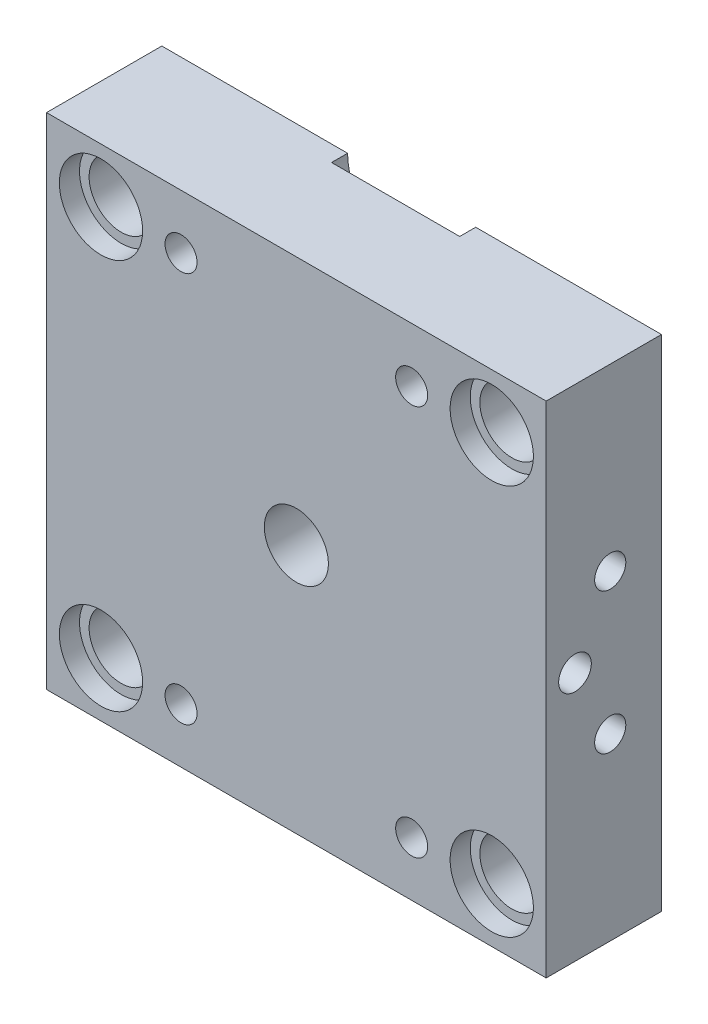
ISO-10303-21;
HEADER;
FILE_DESCRIPTION(('STEP AP214'),'2;1');
FILE_NAME('part.step','',(''),(''),'','','');
FILE_SCHEMA(('AUTOMOTIVE_DESIGN { 1 0 10303 214 1 1 1 1 }'));
ENDSEC;
DATA;
#1=APPLICATION_CONTEXT('core data for automotive mechanical design processes');
#2=APPLICATION_PROTOCOL_DEFINITION('international standard','automotive_design',2000,#1);
#3=PRODUCT_CONTEXT('',#1,'mechanical');
#4=PRODUCT('Part','Part','',(#3));
#5=PRODUCT_RELATED_PRODUCT_CATEGORY('part','',(#4));
#6=PRODUCT_DEFINITION_FORMATION('','',#4);
#7=PRODUCT_DEFINITION_CONTEXT('part definition',#1,'design');
#8=PRODUCT_DEFINITION('design','',#6,#7);
#9=PRODUCT_DEFINITION_SHAPE('','',#8);
#10=(LENGTH_UNIT() NAMED_UNIT(*) SI_UNIT(.MILLI.,.METRE.));
#11=(NAMED_UNIT(*) PLANE_ANGLE_UNIT() SI_UNIT($,.RADIAN.));
#12=(NAMED_UNIT(*) SI_UNIT($,.STERADIAN.) SOLID_ANGLE_UNIT());
#13=UNCERTAINTY_MEASURE_WITH_UNIT(LENGTH_MEASURE(1.E-05),#10,'distance_accuracy_value','');
#14=(GEOMETRIC_REPRESENTATION_CONTEXT(3) GLOBAL_UNCERTAINTY_ASSIGNED_CONTEXT((#13)) GLOBAL_UNIT_ASSIGNED_CONTEXT((#10,
#11,#12)) REPRESENTATION_CONTEXT('',''));
#15=CARTESIAN_POINT('',(0.,0.,0.));
#16=DIRECTION('',(0.,0.,1.));
#17=DIRECTION('',(1.,0.,0.));
#18=AXIS2_PLACEMENT_3D('',#15,#16,#17);
#19=CARTESIAN_POINT('',(-25.,-1.,0.3));
#20=DIRECTION('',(0.,1.,0.));
#21=DIRECTION('',(0.,0.,1.));
#22=AXIS2_PLACEMENT_3D('',#19,#20,#21);
#23=PLANE('',#22);
#24=DIRECTION('',(0.,0.,1.));
#25=VECTOR('',#24,1.);
#26=CARTESIAN_POINT('',(-27.5400642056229,-1.,3.99999999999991));
#27=LINE('',#26,#25);
#28=CARTESIAN_POINT('',(-27.5400642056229,-1.,0.));
#29=VERTEX_POINT('',#28);
#30=CARTESIAN_POINT('',(-27.5400642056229,-1.,0.199999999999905));
#31=VERTEX_POINT('',#30);
#32=EDGE_CURVE('E730',#29,#31,#27,.T.);
#33=ORIENTED_EDGE('',*,*,#32,.T.);
#34=CARTESIAN_POINT('',(-27.5404025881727,-1.,0.250629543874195));
#35=CARTESIAN_POINT('',(-27.543257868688,-1.,0.463514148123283));
#36=CARTESIAN_POINT('',(-27.5641056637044,-1.,0.676313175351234));
#37=CARTESIAN_POINT('',(-27.6412700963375,-1.,1.09556196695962));
#38=CARTESIAN_POINT('',(-27.6976295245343,-1.,1.30200375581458));
#39=CARTESIAN_POINT('',(-27.8441835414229,-1.,1.70240192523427));
#40=CARTESIAN_POINT('',(-27.9343601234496,-1.,1.89636488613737));
#41=CARTESIAN_POINT('',(-28.1459373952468,-1.,2.26636641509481));
#42=CARTESIAN_POINT('',(-28.2673303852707,-1.,2.44240938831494));
#43=CARTESIAN_POINT('',(-28.5380492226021,-1.,2.77189361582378));
#44=CARTESIAN_POINT('',(-28.6874103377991,-1.,2.92530589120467));
#45=CARTESIAN_POINT('',(-29.0097031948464,-1.,3.20497577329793));
#46=CARTESIAN_POINT('',(-29.1826361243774,-1.,3.33123201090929));
#47=CARTESIAN_POINT('',(-29.5477235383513,-1.,3.5534385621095));
#48=CARTESIAN_POINT('',(-29.7399362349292,-1.,3.64929322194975));
#49=CARTESIAN_POINT('',(-30.1376713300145,-1.,3.80754122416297));
#50=CARTESIAN_POINT('',(-30.3431939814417,-1.,3.86993393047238));
#51=CARTESIAN_POINT('',(-30.7627490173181,-1.,3.95981917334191));
#52=CARTESIAN_POINT('',(-30.9768170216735,-1.,3.98714541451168));
#53=CARTESIAN_POINT('',(-31.4065091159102,-1.,4.00569371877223));
#54=CARTESIAN_POINT('',(-31.6221332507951,-1.,3.99691473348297));
#55=CARTESIAN_POINT('',(-32.0501604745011,-1.,3.94344402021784));
#56=CARTESIAN_POINT('',(-32.2625374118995,-1.,3.89854294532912));
#57=CARTESIAN_POINT('',(-32.6768146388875,-1.,3.7739085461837));
#58=CARTESIAN_POINT('',(-32.8787145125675,-1.,3.69417384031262));
#59=CARTESIAN_POINT('',(-33.2673690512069,-1.,3.50165110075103));
#60=CARTESIAN_POINT('',(-33.4540418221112,-1.,3.38869769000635));
#61=CARTESIAN_POINT('',(-33.8057852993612,-1.,3.13305011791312));
#62=CARTESIAN_POINT('',(-33.9708553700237,-1.,2.99035508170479));
#63=CARTESIAN_POINT('',(-34.2745404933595,-1.,2.67921279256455));
#64=CARTESIAN_POINT('',(-34.413162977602,-1.,2.51077279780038));
#65=CARTESIAN_POINT('',(-34.6597887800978,-1.,2.15278676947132));
#66=CARTESIAN_POINT('',(-34.7677939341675,-1.,1.96324200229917));
#67=CARTESIAN_POINT('',(-34.9486573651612,-1.,1.57066947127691));
#68=CARTESIAN_POINT('',(-35.0219014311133,-1.,1.36781958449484));
#69=CARTESIAN_POINT('',(-35.1325544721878,-1.,0.95257710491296));
#70=CARTESIAN_POINT('',(-35.1699687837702,-1.,0.740185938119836));
#71=CARTESIAN_POINT('',(-35.2072822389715,-1.,0.31614845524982));
#72=CARTESIAN_POINT('',(-35.2078701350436,-1.,0.104562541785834));
#73=CARTESIAN_POINT('',(-35.1732466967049,-1.,-0.315651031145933));
#74=CARTESIAN_POINT('',(-35.1380366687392,-1.,-0.524278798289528));
#75=CARTESIAN_POINT('',(-35.0333878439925,-1.,-0.931280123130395));
#76=CARTESIAN_POINT('',(-34.9641753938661,-1.,-1.12971203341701));
#77=CARTESIAN_POINT('',(-34.7938731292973,-1.,-1.51238342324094));
#78=CARTESIAN_POINT('',(-34.6927808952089,-1.,-1.69662182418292));
#79=CARTESIAN_POINT('',(-34.4601656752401,-1.,-2.0484670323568));
#80=CARTESIAN_POINT('',(-34.3282387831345,-1.,-2.21580670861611));
#81=CARTESIAN_POINT('',(-34.0386077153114,-1.,-2.52645095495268));
#82=CARTESIAN_POINT('',(-33.8809013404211,-1.,-2.66975347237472));
#83=CARTESIAN_POINT('',(-33.5411762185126,-1.,-2.9307918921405));
#84=CARTESIAN_POINT('',(-33.3587825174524,-1.,-3.0480400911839));
#85=CARTESIAN_POINT('',(-32.9770046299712,-1.,-3.25050449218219));
#86=CARTESIAN_POINT('',(-32.777619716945,-1.,-3.33571932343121));
#87=CARTESIAN_POINT('',(-32.3659927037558,-1.,-3.47218298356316));
#88=CARTESIAN_POINT('',(-32.1536707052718,-1.,-3.52319103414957));
#89=CARTESIAN_POINT('',(-31.7234672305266,-1.,-3.58875212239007));
#90=CARTESIAN_POINT('',(-31.5055857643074,-1.,-3.6033052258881));
#91=CARTESIAN_POINT('',(-31.0709766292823,-1.,-3.59544451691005));
#92=CARTESIAN_POINT('',(-30.8542474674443,-1.,-3.57311380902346));
#93=CARTESIAN_POINT('',(-30.4276713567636,-1.,-3.49216845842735));
#94=CARTESIAN_POINT('',(-30.2178242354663,-1.,-3.43355472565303));
#95=CARTESIAN_POINT('',(-29.8122455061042,-1.,-3.28206219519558));
#96=CARTESIAN_POINT('',(-29.6164404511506,-1.,-3.18938003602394));
#97=CARTESIAN_POINT('',(-29.2433004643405,-1.,-2.97228320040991));
#98=CARTESIAN_POINT('',(-29.0659642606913,-1.,-2.84787071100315));
#99=CARTESIAN_POINT('',(-28.7358464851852,-1.,-2.57161680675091));
#100=CARTESIAN_POINT('',(-28.5829312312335,-1.,-2.41993511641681));
#101=CARTESIAN_POINT('',(-28.3048282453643,-1.,-2.09291365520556));
#102=CARTESIAN_POINT('',(-28.1796468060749,-1.,-1.91756852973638));
#103=CARTESIAN_POINT('',(-27.9610999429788,-1.,-1.54896075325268));
#104=CARTESIAN_POINT('',(-27.8676188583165,-1.,-1.3557665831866));
#105=CARTESIAN_POINT('',(-27.7146216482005,-1.,-0.956551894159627));
#106=CARTESIAN_POINT('',(-27.6550639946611,-1.,-0.750547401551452));
#107=CARTESIAN_POINT('',(-27.5872893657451,-1.,-0.410918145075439));
#108=CARTESIAN_POINT('',(-27.5681753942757,-1.,-0.279369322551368));
#109=CARTESIAN_POINT('',(-27.5438414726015,-1.,-0.0149927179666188));
#110=CARTESIAN_POINT('',(-27.5386215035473,-1.,0.117835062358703));
#111=CARTESIAN_POINT('',(-27.5404025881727,-1.,0.250629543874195));
#112=B_SPLINE_CURVE_WITH_KNOTS('',3,(#34,#35,#36,#37,#38,#39,#40,#41,#42,#43,#44,#45,#46,#47,
#48,#49,#50,#51,#52,#53,#54,#55,#56,#57,#58,#59,#60,#61,#62,#63,#64,#65,#66,#67,#68,#69,#70,#71,
#72,#73,#74,#75,#76,#77,#78,#79,#80,#81,#82,#83,#84,#85,#86,#87,#88,#89,#90,#91,#92,#93,#94,#95,
#96,#97,#98,#99,#100,#101,#102,#103,#104,#105,#106,#107,#108,#109,#110,#111),.UNSPECIFIED.,.T.,
.F.,(4,2,2,2,2,2,2,2,2,2,2,2,2,2,2,2,2,2,2,2,2,2,2,2,2,2,2,2,2,2,2,2,2,2,2,2,2,2,4),(0.,
0.638225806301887,1.27722213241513,1.91587869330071,2.55437787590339,3.19368769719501,
3.83302974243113,4.4743638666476,5.1157101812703,5.7600868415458,6.40448221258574,
7.05263933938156,7.70082217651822,8.35228821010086,9.00377340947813,9.65507527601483,
10.3063380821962,10.9501934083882,11.5939528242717,12.225668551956,12.857361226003,
13.4849047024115,14.1124958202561,14.7488206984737,15.3851998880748,16.0326407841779,
16.6801093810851,17.3320889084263,17.9840672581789,18.6345786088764,19.2850736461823,
19.9318716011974,20.5786249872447,21.2217067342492,21.8649342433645,22.5057889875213,
23.1458575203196,23.5439745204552,23.9420909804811),.UNSPECIFIED.);
#113=CARTESIAN_POINT('',(-27.541384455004,-1.,0.3));
#114=VERTEX_POINT('',#113);
#115=EDGE_CURVE('E193',#31,#114,#112,.T.);
#116=ORIENTED_EDGE('',*,*,#115,.T.);
#117=DIRECTION('',(1.,0.,0.));
#118=VECTOR('',#117,1.);
#119=CARTESIAN_POINT('',(-25.,-1.,0.3));
#120=LINE('',#119,#118);
#121=CARTESIAN_POINT('',(-25.,-1.,0.3));
#122=VERTEX_POINT('',#121);
#123=EDGE_CURVE('E502',#114,#122,#120,.T.);
#124=ORIENTED_EDGE('',*,*,#123,.T.);
#125=DIRECTION('',(0.,0.,-1.));
#126=VECTOR('',#125,1.);
#127=CARTESIAN_POINT('',(-25.,-1.,0.3));
#128=LINE('',#127,#126);
#129=CARTESIAN_POINT('',(-25.,-1.,0.));
#130=VERTEX_POINT('',#129);
#131=EDGE_CURVE('E488',#122,#130,#128,.T.);
#132=ORIENTED_EDGE('',*,*,#131,.T.);
#133=DIRECTION('',(1.,0.,0.));
#134=VECTOR('',#133,1.);
#135=CARTESIAN_POINT('',(-25.,-1.,0.));
#136=LINE('',#135,#134);
#137=EDGE_CURVE('E491',#29,#130,#136,.T.);
#138=ORIENTED_EDGE('',*,*,#137,.F.);
#139=EDGE_LOOP('',(#33,#116,#124,#132,#138));
#140=FACE_BOUND('',#139,.T.);
#141=ADVANCED_FACE('F41',(#140),#23,.T.);
#142=CARTESIAN_POINT('',(-28.2,1.,0.3));
#143=DIRECTION('',(0.,-1.,0.));
#144=DIRECTION('',(0.,0.,-1.));
#145=AXIS2_PLACEMENT_3D('',#142,#143,#144);
#146=PLANE('',#145);
#147=DIRECTION('',(-1.,0.,0.));
#148=VECTOR('',#147,1.);
#149=CARTESIAN_POINT('',(-28.2,1.,0.3));
#150=LINE('',#149,#148);
#151=CARTESIAN_POINT('',(-25.,1.,0.3));
#152=VERTEX_POINT('',#151);
#153=CARTESIAN_POINT('',(-27.541384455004,1.,0.3));
#154=VERTEX_POINT('',#153);
#155=EDGE_CURVE('E200',#152,#154,#150,.T.);
#156=ORIENTED_EDGE('',*,*,#155,.T.);
#157=CARTESIAN_POINT('',(-27.5404025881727,1.,0.250629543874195));
#158=CARTESIAN_POINT('',(-27.5375666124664,1.,0.03776454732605));
#159=CARTESIAN_POINT('',(-27.5527156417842,1.,-0.175495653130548));
#160=CARTESIAN_POINT('',(-27.6186350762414,1.,-0.596618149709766));
#161=CARTESIAN_POINT('',(-27.6694484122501,1.,-0.804473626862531));
#162=CARTESIAN_POINT('',(-27.8052300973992,1.,-1.20861040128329));
#163=CARTESIAN_POINT('',(-27.8901804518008,1.,-1.40489773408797));
#164=CARTESIAN_POINT('',(-28.091773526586,1.,-1.78038912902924));
#165=CARTESIAN_POINT('',(-28.2084084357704,1.,-1.95959738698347));
#166=CARTESIAN_POINT('',(-28.4701950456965,1.,-2.29614961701));
#167=CARTESIAN_POINT('',(-28.6153802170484,1.,-2.45346755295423));
#168=CARTESIAN_POINT('',(-28.9300365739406,1.,-2.74158877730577));
#169=CARTESIAN_POINT('',(-29.0995089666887,1.,-2.87239074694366));
#170=CARTESIAN_POINT('',(-29.4584537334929,1.,-3.10419654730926));
#171=CARTESIAN_POINT('',(-29.647984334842,1.,-3.20511020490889));
#172=CARTESIAN_POINT('',(-30.0412396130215,1.,-3.37384877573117));
#173=CARTESIAN_POINT('',(-30.2449645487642,1.,-3.44167308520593));
#174=CARTESIAN_POINT('',(-30.6618239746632,1.,-3.54265935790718));
#175=CARTESIAN_POINT('',(-30.8749974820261,1.,-3.57566023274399));
#176=CARTESIAN_POINT('',(-31.3038598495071,1.,-3.60562541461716));
#177=CARTESIAN_POINT('',(-31.519548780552,1.,-3.60258870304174));
#178=CARTESIAN_POINT('',(-31.9486531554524,1.,-3.56054572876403));
#179=CARTESIAN_POINT('',(-32.1620481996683,1.,-3.52133126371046));
#180=CARTESIAN_POINT('',(-32.5792986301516,1.,-3.40782662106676));
#181=CARTESIAN_POINT('',(-32.7831536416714,1.,-3.33353506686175));
#182=CARTESIAN_POINT('',(-33.1766556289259,1.,-3.15152014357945));
#183=CARTESIAN_POINT('',(-33.366222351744,1.,-3.04362322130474));
#184=CARTESIAN_POINT('',(-33.7245769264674,1.,-2.79755095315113));
#185=CARTESIAN_POINT('',(-33.893364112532,1.,-2.65937463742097));
#186=CARTESIAN_POINT('',(-34.2053267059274,1.,-2.35650758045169));
#187=CARTESIAN_POINT('',(-34.3484924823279,1.,-2.19180691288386));
#188=CARTESIAN_POINT('',(-34.6048087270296,1.,-1.84049347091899));
#189=CARTESIAN_POINT('',(-34.7179606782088,1.,-1.65388177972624));
#190=CARTESIAN_POINT('',(-34.909623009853,1.,-1.26604915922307));
#191=CARTESIAN_POINT('',(-34.9884815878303,1.,-1.06500044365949));
#192=CARTESIAN_POINT('',(-35.1105915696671,1.,-0.652371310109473));
#193=CARTESIAN_POINT('',(-35.153848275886,1.,-0.440792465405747));
#194=CARTESIAN_POINT('',(-35.2027615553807,1.,-0.0173531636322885));
#195=CARTESIAN_POINT('',(-35.2091066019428,1.,0.194427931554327));
#196=CARTESIAN_POINT('',(-35.1858172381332,1.,0.615993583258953));
#197=CARTESIAN_POINT('',(-35.1561846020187,1.,0.82577823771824));
#198=CARTESIAN_POINT('',(-35.0623694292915,1.,1.23563514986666));
#199=CARTESIAN_POINT('',(-34.9984729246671,1.,1.43577307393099));
#200=CARTESIAN_POINT('',(-34.8384063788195,1.,1.82269146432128));
#201=CARTESIAN_POINT('',(-34.7422340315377,1.,2.00947097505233));
#202=CARTESIAN_POINT('',(-34.5191424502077,1.,2.36697198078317));
#203=CARTESIAN_POINT('',(-34.3918478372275,1.,2.53745911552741));
#204=CARTESIAN_POINT('',(-34.1109108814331,1.,2.85513035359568));
#205=CARTESIAN_POINT('',(-33.9572662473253,1.,3.00231242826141));
#206=CARTESIAN_POINT('',(-33.6249833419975,1.,3.27188527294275));
#207=CARTESIAN_POINT('',(-33.4459482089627,1.,3.39378711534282));
#208=CARTESIAN_POINT('',(-33.0700801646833,1.,3.60608594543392));
#209=CARTESIAN_POINT('',(-32.8732464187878,1.,3.69648145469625));
#210=CARTESIAN_POINT('',(-32.4656602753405,1.,3.84381047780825));
#211=CARTESIAN_POINT('',(-32.2548102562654,1.,3.90047416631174));
#212=CARTESIAN_POINT('',(-31.8265799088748,1.,3.97753392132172));
#213=CARTESIAN_POINT('',(-31.6091995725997,1.,3.99792994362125));
#214=CARTESIAN_POINT('',(-31.1744856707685,1.,4.00176669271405));
#215=CARTESIAN_POINT('',(-30.9571526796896,1.,3.98527154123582));
#216=CARTESIAN_POINT('',(-30.5283908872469,1.,3.91581559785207));
#217=CARTESIAN_POINT('',(-30.3169619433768,1.,3.8628556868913));
#218=CARTESIAN_POINT('',(-29.9072736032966,1.,3.72228526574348));
#219=CARTESIAN_POINT('',(-29.7089473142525,1.,3.63486972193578));
#220=CARTESIAN_POINT('',(-29.3299133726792,1.,3.42780195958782));
#221=CARTESIAN_POINT('',(-29.1492045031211,1.,3.30815196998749));
#222=CARTESIAN_POINT('',(-28.8116223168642,1.,3.04076489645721));
#223=CARTESIAN_POINT('',(-28.6546177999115,1.,2.89319343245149));
#224=CARTESIAN_POINT('',(-28.3677044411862,1.,2.5736420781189));
#225=CARTESIAN_POINT('',(-28.2378017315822,1.,2.40165667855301));
#226=CARTESIAN_POINT('',(-28.0093527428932,1.,2.03893167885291));
#227=CARTESIAN_POINT('',(-27.9106886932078,1.,1.84826615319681));
#228=CARTESIAN_POINT('',(-27.7469826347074,1.,1.45319567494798));
#229=CARTESIAN_POINT('',(-27.6818995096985,1.,1.24880787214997));
#230=CARTESIAN_POINT('',(-27.605012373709,1.,0.911000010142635));
#231=CARTESIAN_POINT('',(-27.5823686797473,1.,0.779947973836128));
#232=CARTESIAN_POINT('',(-27.5509488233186,1.,0.516191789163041));
#233=CARTESIAN_POINT('',(-27.5421726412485,1.,0.383487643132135));
#234=CARTESIAN_POINT('',(-27.5404025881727,1.,0.250629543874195));
#235=B_SPLINE_CURVE_WITH_KNOTS('',3,(#157,#158,#159,#160,#161,#162,#163,#164,#165,#166,#167,
#168,#169,#170,#171,#172,#173,#174,#175,#176,#177,#178,#179,#180,#181,#182,#183,#184,#185,#186,
#187,#188,#189,#190,#191,#192,#193,#194,#195,#196,#197,#198,#199,#200,#201,#202,#203,#204,#205,
#206,#207,#208,#209,#210,#211,#212,#213,#214,#215,#216,#217,#218,#219,#220,#221,#222,#223,#224,
#225,#226,#227,#228,#229,#230,#231,#232,#233,#234),.UNSPECIFIED.,.T.,.F.,(4,2,2,2,2,2,2,2,2,2,2,
2,2,2,2,2,2,2,2,2,2,2,2,2,2,2,2,2,2,2,2,2,2,2,2,2,2,2,4),(0.,0.638166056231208,1.2771016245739,
1.91570082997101,2.55414274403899,3.1933376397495,3.83256431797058,4.47370034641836,
5.11484807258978,5.75894882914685,6.40306779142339,7.05091692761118,7.6987914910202,
8.3500690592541,9.00136749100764,9.65291022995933,10.3044207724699,10.9491523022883,
11.5937877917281,12.2263600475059,12.8589011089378,13.486242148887,14.1136280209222,
14.7489906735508,15.3844086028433,16.0311583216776,16.677938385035,17.3298249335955,
17.9817122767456,18.6324674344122,19.2832068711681,19.9303157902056,20.5773799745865,
21.2207199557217,21.8642053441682,22.5052350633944,23.1454780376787,23.5437851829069,
23.9420917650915),.UNSPECIFIED.);
#236=CARTESIAN_POINT('',(-27.5400642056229,0.999999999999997,0.199999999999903));
#237=VERTEX_POINT('',#236);
#238=EDGE_CURVE('E56',#154,#237,#235,.T.);
#239=ORIENTED_EDGE('',*,*,#238,.T.);
#240=DIRECTION('',(0.,0.,1.));
#241=VECTOR('',#240,1.);
#242=CARTESIAN_POINT('',(-27.5400642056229,1.,3.99999999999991));
#243=LINE('',#242,#241);
#244=CARTESIAN_POINT('',(-27.5400642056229,0.999999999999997,0.));
#245=VERTEX_POINT('',#244);
#246=EDGE_CURVE('E11',#237,#245,#243,.F.);
#247=ORIENTED_EDGE('',*,*,#246,.T.);
#248=DIRECTION('',(-1.,0.,0.));
#249=VECTOR('',#248,1.);
#250=CARTESIAN_POINT('',(-28.2,1.,0.));
#251=LINE('',#250,#249);
#252=CARTESIAN_POINT('',(-25.,1.,0.));
#253=VERTEX_POINT('',#252);
#254=EDGE_CURVE('E492',#253,#245,#251,.T.);
#255=ORIENTED_EDGE('',*,*,#254,.F.);
#256=DIRECTION('',(0.,0.,-1.));
#257=VECTOR('',#256,1.);
#258=CARTESIAN_POINT('',(-25.,1.,0.3));
#259=LINE('',#258,#257);
#260=EDGE_CURVE('E490',#152,#253,#259,.T.);
#261=ORIENTED_EDGE('',*,*,#260,.F.);
#262=EDGE_LOOP('',(#156,#239,#247,#255,#261));
#263=FACE_BOUND('',#262,.T.);
#264=ADVANCED_FACE('F197',(#263),#146,.T.);
#265=CARTESIAN_POINT('',(28.2,1.,0.3));
#266=DIRECTION('',(0.,1.,0.));
#267=DIRECTION('',(0.,0.,1.));
#268=AXIS2_PLACEMENT_3D('',#265,#266,#267);
#269=PLANE('',#268);
#270=CARTESIAN_POINT('',(27.5404025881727,1.,0.250629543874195));
#271=CARTESIAN_POINT('',(27.5375666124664,1.,0.03776454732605));
#272=CARTESIAN_POINT('',(27.5527156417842,1.,-0.175495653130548));
#273=CARTESIAN_POINT('',(27.6186350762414,1.,-0.596618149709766));
#274=CARTESIAN_POINT('',(27.6694484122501,1.,-0.804473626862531));
#275=CARTESIAN_POINT('',(27.8052300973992,1.,-1.20861040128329));
#276=CARTESIAN_POINT('',(27.8901804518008,1.,-1.40489773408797));
#277=CARTESIAN_POINT('',(28.091773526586,1.,-1.78038912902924));
#278=CARTESIAN_POINT('',(28.2084084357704,1.,-1.95959738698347));
#279=CARTESIAN_POINT('',(28.4701950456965,1.,-2.29614961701));
#280=CARTESIAN_POINT('',(28.6153802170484,1.,-2.45346755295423));
#281=CARTESIAN_POINT('',(28.9300365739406,1.,-2.74158877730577));
#282=CARTESIAN_POINT('',(29.0995089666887,1.,-2.87239074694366));
#283=CARTESIAN_POINT('',(29.4584537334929,1.,-3.10419654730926));
#284=CARTESIAN_POINT('',(29.647984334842,1.,-3.20511020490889));
#285=CARTESIAN_POINT('',(30.0412396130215,1.,-3.37384877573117));
#286=CARTESIAN_POINT('',(30.2449645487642,1.,-3.44167308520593));
#287=CARTESIAN_POINT('',(30.6618239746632,1.,-3.54265935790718));
#288=CARTESIAN_POINT('',(30.8749974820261,1.,-3.57566023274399));
#289=CARTESIAN_POINT('',(31.3038598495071,1.,-3.60562541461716));
#290=CARTESIAN_POINT('',(31.519548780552,1.,-3.60258870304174));
#291=CARTESIAN_POINT('',(31.9486531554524,1.,-3.56054572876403));
#292=CARTESIAN_POINT('',(32.1620481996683,1.,-3.52133126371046));
#293=CARTESIAN_POINT('',(32.5792986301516,1.,-3.40782662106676));
#294=CARTESIAN_POINT('',(32.7831536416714,1.,-3.33353506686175));
#295=CARTESIAN_POINT('',(33.1766556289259,1.,-3.15152014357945));
#296=CARTESIAN_POINT('',(33.366222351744,1.,-3.04362322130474));
#297=CARTESIAN_POINT('',(33.7245769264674,1.,-2.79755095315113));
#298=CARTESIAN_POINT('',(33.893364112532,1.,-2.65937463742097));
#299=CARTESIAN_POINT('',(34.2053267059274,1.,-2.35650758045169));
#300=CARTESIAN_POINT('',(34.3484924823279,1.,-2.19180691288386));
#301=CARTESIAN_POINT('',(34.6048087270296,1.,-1.84049347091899));
#302=CARTESIAN_POINT('',(34.7179606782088,1.,-1.65388177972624));
#303=CARTESIAN_POINT('',(34.909623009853,1.,-1.26604915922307));
#304=CARTESIAN_POINT('',(34.9884815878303,1.,-1.06500044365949));
#305=CARTESIAN_POINT('',(35.1105915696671,1.,-0.652371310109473));
#306=CARTESIAN_POINT('',(35.153848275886,1.,-0.440792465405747));
#307=CARTESIAN_POINT('',(35.2027615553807,1.,-0.0173531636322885));
#308=CARTESIAN_POINT('',(35.2091066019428,1.,0.194427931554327));
#309=CARTESIAN_POINT('',(35.1858172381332,1.,0.615993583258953));
#310=CARTESIAN_POINT('',(35.1561846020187,1.,0.82577823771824));
#311=CARTESIAN_POINT('',(35.0623694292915,1.,1.23563514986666));
#312=CARTESIAN_POINT('',(34.9984729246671,1.,1.43577307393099));
#313=CARTESIAN_POINT('',(34.8384063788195,1.,1.82269146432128));
#314=CARTESIAN_POINT('',(34.7422340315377,1.,2.00947097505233));
#315=CARTESIAN_POINT('',(34.5191424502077,1.,2.36697198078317));
#316=CARTESIAN_POINT('',(34.3918478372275,1.,2.53745911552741));
#317=CARTESIAN_POINT('',(34.1109108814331,1.,2.85513035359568));
#318=CARTESIAN_POINT('',(33.9572662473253,1.,3.00231242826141));
#319=CARTESIAN_POINT('',(33.6249833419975,1.,3.27188527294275));
#320=CARTESIAN_POINT('',(33.4459482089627,1.,3.39378711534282));
#321=CARTESIAN_POINT('',(33.0700801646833,1.,3.60608594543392));
#322=CARTESIAN_POINT('',(32.8732464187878,1.,3.69648145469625));
#323=CARTESIAN_POINT('',(32.4656602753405,1.,3.84381047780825));
#324=CARTESIAN_POINT('',(32.2548102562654,1.,3.90047416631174));
#325=CARTESIAN_POINT('',(31.8265799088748,1.,3.97753392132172));
#326=CARTESIAN_POINT('',(31.6091995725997,1.,3.99792994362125));
#327=CARTESIAN_POINT('',(31.1744856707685,1.,4.00176669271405));
#328=CARTESIAN_POINT('',(30.9571526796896,1.,3.98527154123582));
#329=CARTESIAN_POINT('',(30.5283908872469,1.,3.91581559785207));
#330=CARTESIAN_POINT('',(30.3169619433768,1.,3.8628556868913));
#331=CARTESIAN_POINT('',(29.9072736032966,1.,3.72228526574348));
#332=CARTESIAN_POINT('',(29.7089473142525,1.,3.63486972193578));
#333=CARTESIAN_POINT('',(29.3299133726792,1.,3.42780195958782));
#334=CARTESIAN_POINT('',(29.1492045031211,1.,3.30815196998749));
#335=CARTESIAN_POINT('',(28.8116223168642,1.,3.04076489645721));
#336=CARTESIAN_POINT('',(28.6546177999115,1.,2.89319343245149));
#337=CARTESIAN_POINT('',(28.3677044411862,1.,2.5736420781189));
#338=CARTESIAN_POINT('',(28.2378017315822,1.,2.40165667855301));
#339=CARTESIAN_POINT('',(28.0093527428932,1.,2.03893167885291));
#340=CARTESIAN_POINT('',(27.9106886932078,1.,1.84826615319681));
#341=CARTESIAN_POINT('',(27.7469826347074,1.,1.45319567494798));
#342=CARTESIAN_POINT('',(27.6818995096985,1.,1.24880787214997));
#343=CARTESIAN_POINT('',(27.605012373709,1.,0.911000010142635));
#344=CARTESIAN_POINT('',(27.5823686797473,1.,0.779947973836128));
#345=CARTESIAN_POINT('',(27.5509488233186,1.,0.516191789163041));
#346=CARTESIAN_POINT('',(27.5421726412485,1.,0.383487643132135));
#347=CARTESIAN_POINT('',(27.5404025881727,1.,0.250629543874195));
#348=B_SPLINE_CURVE_WITH_KNOTS('',3,(#270,#271,#272,#273,#274,#275,#276,#277,#278,#279,#280,
#281,#282,#283,#284,#285,#286,#287,#288,#289,#290,#291,#292,#293,#294,#295,#296,#297,#298,#299,
#300,#301,#302,#303,#304,#305,#306,#307,#308,#309,#310,#311,#312,#313,#314,#315,#316,#317,#318,
#319,#320,#321,#322,#323,#324,#325,#326,#327,#328,#329,#330,#331,#332,#333,#334,#335,#336,#337,
#338,#339,#340,#341,#342,#343,#344,#345,#346,#347),.UNSPECIFIED.,.T.,.F.,(4,2,2,2,2,2,2,2,2,2,2,
2,2,2,2,2,2,2,2,2,2,2,2,2,2,2,2,2,2,2,2,2,2,2,2,2,2,2,4),(0.,0.638166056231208,1.2771016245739,
1.91570082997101,2.55414274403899,3.1933376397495,3.83256431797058,4.47370034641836,
5.11484807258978,5.75894882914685,6.40306779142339,7.05091692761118,7.6987914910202,
8.3500690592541,9.00136749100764,9.65291022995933,10.3044207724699,10.9491523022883,
11.5937877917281,12.2263600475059,12.8589011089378,13.486242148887,14.1136280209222,
14.7489906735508,15.3844086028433,16.0311583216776,16.677938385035,17.3298249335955,
17.9817122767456,18.6324674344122,19.2832068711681,19.9303157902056,20.5773799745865,
21.2207199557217,21.8642053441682,22.5052350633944,23.1454780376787,23.5437851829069,
23.9420917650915),.UNSPECIFIED.);
#349=CARTESIAN_POINT('',(27.541384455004,1.,0.3));
#350=VERTEX_POINT('',#349);
#351=CARTESIAN_POINT('',(27.5400642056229,0.999999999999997,0.199999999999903));
#352=VERTEX_POINT('',#351);
#353=EDGE_CURVE('E244',#350,#352,#348,.T.);
#354=ORIENTED_EDGE('',*,*,#353,.F.);
#355=DIRECTION('',(1.,0.,0.));
#356=VECTOR('',#355,1.);
#357=CARTESIAN_POINT('',(28.2,1.,0.3));
#358=LINE('',#357,#356);
#359=CARTESIAN_POINT('',(25.,1.,0.3));
#360=VERTEX_POINT('',#359);
#361=EDGE_CURVE('E509',#360,#350,#358,.T.);
#362=ORIENTED_EDGE('',*,*,#361,.F.);
#363=DIRECTION('',(0.,0.,-1.));
#364=VECTOR('',#363,1.);
#365=CARTESIAN_POINT('',(25.,1.,0.3));
#366=LINE('',#365,#364);
#367=CARTESIAN_POINT('',(25.,1.,0.));
#368=VERTEX_POINT('',#367);
#369=EDGE_CURVE('E519',#360,#368,#366,.T.);
#370=ORIENTED_EDGE('',*,*,#369,.T.);
#371=DIRECTION('',(1.,0.,0.));
#372=VECTOR('',#371,1.);
#373=CARTESIAN_POINT('',(28.2,1.,0.));
#374=LINE('',#373,#372);
#375=CARTESIAN_POINT('',(27.5400642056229,1.,0.));
#376=VERTEX_POINT('',#375);
#377=EDGE_CURVE('E506',#368,#376,#374,.T.);
#378=ORIENTED_EDGE('',*,*,#377,.T.);
#379=DIRECTION('',(0.,0.,1.));
#380=VECTOR('',#379,1.);
#381=CARTESIAN_POINT('',(27.5400642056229,1.,3.99999999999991));
#382=LINE('',#381,#380);
#383=EDGE_CURVE('E495',#352,#376,#382,.F.);
#384=ORIENTED_EDGE('',*,*,#383,.F.);
#385=EDGE_LOOP('',(#354,#362,#370,#378,#384));
#386=FACE_BOUND('',#385,.T.);
#387=ADVANCED_FACE('F251',(#386),#269,.F.);
#388=CARTESIAN_POINT('',(25.,-1.,0.3));
#389=DIRECTION('',(0.,-1.,0.));
#390=DIRECTION('',(0.,0.,-1.));
#391=AXIS2_PLACEMENT_3D('',#388,#389,#390);
#392=PLANE('',#391);
#393=CARTESIAN_POINT('',(27.5404025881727,-1.,0.250629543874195));
#394=CARTESIAN_POINT('',(27.543257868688,-1.,0.463514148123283));
#395=CARTESIAN_POINT('',(27.5641056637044,-1.,0.676313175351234));
#396=CARTESIAN_POINT('',(27.6412700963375,-1.,1.09556196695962));
#397=CARTESIAN_POINT('',(27.6976295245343,-1.,1.30200375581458));
#398=CARTESIAN_POINT('',(27.8441835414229,-1.,1.70240192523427));
#399=CARTESIAN_POINT('',(27.9343601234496,-1.,1.89636488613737));
#400=CARTESIAN_POINT('',(28.1459373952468,-1.,2.26636641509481));
#401=CARTESIAN_POINT('',(28.2673303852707,-1.,2.44240938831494));
#402=CARTESIAN_POINT('',(28.5380492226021,-1.,2.77189361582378));
#403=CARTESIAN_POINT('',(28.6874103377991,-1.,2.92530589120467));
#404=CARTESIAN_POINT('',(29.0097031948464,-1.,3.20497577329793));
#405=CARTESIAN_POINT('',(29.1826361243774,-1.,3.33123201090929));
#406=CARTESIAN_POINT('',(29.5477235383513,-1.,3.5534385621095));
#407=CARTESIAN_POINT('',(29.7399362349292,-1.,3.64929322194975));
#408=CARTESIAN_POINT('',(30.1376713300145,-1.,3.80754122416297));
#409=CARTESIAN_POINT('',(30.3431939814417,-1.,3.86993393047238));
#410=CARTESIAN_POINT('',(30.7627490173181,-1.,3.95981917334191));
#411=CARTESIAN_POINT('',(30.9768170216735,-1.,3.98714541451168));
#412=CARTESIAN_POINT('',(31.4065091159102,-1.,4.00569371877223));
#413=CARTESIAN_POINT('',(31.6221332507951,-1.,3.99691473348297));
#414=CARTESIAN_POINT('',(32.0501604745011,-1.,3.94344402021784));
#415=CARTESIAN_POINT('',(32.2625374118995,-1.,3.89854294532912));
#416=CARTESIAN_POINT('',(32.6768146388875,-1.,3.7739085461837));
#417=CARTESIAN_POINT('',(32.8787145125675,-1.,3.69417384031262));
#418=CARTESIAN_POINT('',(33.2673690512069,-1.,3.50165110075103));
#419=CARTESIAN_POINT('',(33.4540418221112,-1.,3.38869769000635));
#420=CARTESIAN_POINT('',(33.8057852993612,-1.,3.13305011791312));
#421=CARTESIAN_POINT('',(33.9708553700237,-1.,2.99035508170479));
#422=CARTESIAN_POINT('',(34.2745404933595,-1.,2.67921279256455));
#423=CARTESIAN_POINT('',(34.413162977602,-1.,2.51077279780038));
#424=CARTESIAN_POINT('',(34.6597887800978,-1.,2.15278676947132));
#425=CARTESIAN_POINT('',(34.7677939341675,-1.,1.96324200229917));
#426=CARTESIAN_POINT('',(34.9486573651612,-1.,1.57066947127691));
#427=CARTESIAN_POINT('',(35.0219014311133,-1.,1.36781958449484));
#428=CARTESIAN_POINT('',(35.1325544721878,-1.,0.95257710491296));
#429=CARTESIAN_POINT('',(35.1699687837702,-1.,0.740185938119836));
#430=CARTESIAN_POINT('',(35.2072822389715,-1.,0.31614845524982));
#431=CARTESIAN_POINT('',(35.2078701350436,-1.,0.104562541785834));
#432=CARTESIAN_POINT('',(35.1732466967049,-1.,-0.315651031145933));
#433=CARTESIAN_POINT('',(35.1380366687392,-1.,-0.524278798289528));
#434=CARTESIAN_POINT('',(35.0333878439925,-1.,-0.931280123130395));
#435=CARTESIAN_POINT('',(34.9641753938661,-1.,-1.12971203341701));
#436=CARTESIAN_POINT('',(34.7938731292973,-1.,-1.51238342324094));
#437=CARTESIAN_POINT('',(34.6927808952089,-1.,-1.69662182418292));
#438=CARTESIAN_POINT('',(34.4601656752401,-1.,-2.0484670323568));
#439=CARTESIAN_POINT('',(34.3282387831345,-1.,-2.21580670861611));
#440=CARTESIAN_POINT('',(34.0386077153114,-1.,-2.52645095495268));
#441=CARTESIAN_POINT('',(33.8809013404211,-1.,-2.66975347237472));
#442=CARTESIAN_POINT('',(33.5411762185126,-1.,-2.9307918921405));
#443=CARTESIAN_POINT('',(33.3587825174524,-1.,-3.0480400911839));
#444=CARTESIAN_POINT('',(32.9770046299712,-1.,-3.25050449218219));
#445=CARTESIAN_POINT('',(32.777619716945,-1.,-3.33571932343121));
#446=CARTESIAN_POINT('',(32.3659927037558,-1.,-3.47218298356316));
#447=CARTESIAN_POINT('',(32.1536707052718,-1.,-3.52319103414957));
#448=CARTESIAN_POINT('',(31.7234672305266,-1.,-3.58875212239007));
#449=CARTESIAN_POINT('',(31.5055857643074,-1.,-3.6033052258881));
#450=CARTESIAN_POINT('',(31.0709766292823,-1.,-3.59544451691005));
#451=CARTESIAN_POINT('',(30.8542474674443,-1.,-3.57311380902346));
#452=CARTESIAN_POINT('',(30.4276713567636,-1.,-3.49216845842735));
#453=CARTESIAN_POINT('',(30.2178242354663,-1.,-3.43355472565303));
#454=CARTESIAN_POINT('',(29.8122455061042,-1.,-3.28206219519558));
#455=CARTESIAN_POINT('',(29.6164404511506,-1.,-3.18938003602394));
#456=CARTESIAN_POINT('',(29.2433004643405,-1.,-2.97228320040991));
#457=CARTESIAN_POINT('',(29.0659642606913,-1.,-2.84787071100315));
#458=CARTESIAN_POINT('',(28.7358464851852,-1.,-2.57161680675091));
#459=CARTESIAN_POINT('',(28.5829312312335,-1.,-2.41993511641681));
#460=CARTESIAN_POINT('',(28.3048282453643,-1.,-2.09291365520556));
#461=CARTESIAN_POINT('',(28.1796468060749,-1.,-1.91756852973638));
#462=CARTESIAN_POINT('',(27.9610999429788,-1.,-1.54896075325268));
#463=CARTESIAN_POINT('',(27.8676188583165,-1.,-1.3557665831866));
#464=CARTESIAN_POINT('',(27.7146216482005,-1.,-0.956551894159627));
#465=CARTESIAN_POINT('',(27.6550639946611,-1.,-0.750547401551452));
#466=CARTESIAN_POINT('',(27.5872893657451,-1.,-0.410918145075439));
#467=CARTESIAN_POINT('',(27.5681753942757,-1.,-0.279369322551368));
#468=CARTESIAN_POINT('',(27.5438414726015,-1.,-0.0149927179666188));
#469=CARTESIAN_POINT('',(27.5386215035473,-1.,0.117835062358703));
#470=CARTESIAN_POINT('',(27.5404025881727,-1.,0.250629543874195));
#471=B_SPLINE_CURVE_WITH_KNOTS('',3,(#393,#394,#395,#396,#397,#398,#399,#400,#401,#402,#403,
#404,#405,#406,#407,#408,#409,#410,#411,#412,#413,#414,#415,#416,#417,#418,#419,#420,#421,#422,
#423,#424,#425,#426,#427,#428,#429,#430,#431,#432,#433,#434,#435,#436,#437,#438,#439,#440,#441,
#442,#443,#444,#445,#446,#447,#448,#449,#450,#451,#452,#453,#454,#455,#456,#457,#458,#459,#460,
#461,#462,#463,#464,#465,#466,#467,#468,#469,#470),.UNSPECIFIED.,.T.,.F.,(4,2,2,2,2,2,2,2,2,2,2,
2,2,2,2,2,2,2,2,2,2,2,2,2,2,2,2,2,2,2,2,2,2,2,2,2,2,2,4),(0.,0.638225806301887,1.27722213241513,
1.91587869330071,2.55437787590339,3.19368769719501,3.83302974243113,4.4743638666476,
5.1157101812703,5.7600868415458,6.40448221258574,7.05263933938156,7.70082217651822,
8.35228821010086,9.00377340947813,9.65507527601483,10.3063380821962,10.9501934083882,
11.5939528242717,12.225668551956,12.857361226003,13.4849047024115,14.1124958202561,
14.7488206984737,15.3851998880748,16.0326407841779,16.6801093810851,17.3320889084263,
17.9840672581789,18.6345786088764,19.2850736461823,19.9318716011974,20.5786249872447,
21.2217067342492,21.8649342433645,22.5057889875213,23.1458575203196,23.5439745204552,
23.9420909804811),.UNSPECIFIED.);
#472=CARTESIAN_POINT('',(27.5400642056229,-1.,0.199999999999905));
#473=VERTEX_POINT('',#472);
#474=CARTESIAN_POINT('',(27.541384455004,-1.,0.3));
#475=VERTEX_POINT('',#474);
#476=EDGE_CURVE('E64',#473,#475,#471,.T.);
#477=ORIENTED_EDGE('',*,*,#476,.F.);
#478=DIRECTION('',(0.,0.,1.));
#479=VECTOR('',#478,1.);
#480=CARTESIAN_POINT('',(27.5400642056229,-1.,3.99999999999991));
#481=LINE('',#480,#479);
#482=CARTESIAN_POINT('',(27.5400642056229,-1.,0.));
#483=VERTEX_POINT('',#482);
#484=EDGE_CURVE('E727',#483,#473,#481,.T.);
#485=ORIENTED_EDGE('',*,*,#484,.F.);
#486=DIRECTION('',(-1.,0.,0.));
#487=VECTOR('',#486,1.);
#488=CARTESIAN_POINT('',(25.,-1.,0.));
#489=LINE('',#488,#487);
#490=CARTESIAN_POINT('',(25.,-1.,0.));
#491=VERTEX_POINT('',#490);
#492=EDGE_CURVE('E500',#483,#491,#489,.T.);
#493=ORIENTED_EDGE('',*,*,#492,.T.);
#494=DIRECTION('',(0.,0.,-1.));
#495=VECTOR('',#494,1.);
#496=CARTESIAN_POINT('',(25.,-1.,0.3));
#497=LINE('',#496,#495);
#498=CARTESIAN_POINT('',(25.,-1.,0.3));
#499=VERTEX_POINT('',#498);
#500=EDGE_CURVE('E512',#499,#491,#497,.T.);
#501=ORIENTED_EDGE('',*,*,#500,.F.);
#502=DIRECTION('',(-1.,0.,0.));
#503=VECTOR('',#502,1.);
#504=CARTESIAN_POINT('',(25.,-1.,0.3));
#505=LINE('',#504,#503);
#506=EDGE_CURVE('E503',#475,#499,#505,.T.);
#507=ORIENTED_EDGE('',*,*,#506,.F.);
#508=EDGE_LOOP('',(#477,#485,#493,#501,#507));
#509=FACE_BOUND('',#508,.T.);
#510=ADVANCED_FACE('F255',(#509),#392,.F.);
#511=CARTESIAN_POINT('',(-78.,-78.,0.));
#512=DIRECTION('',(0.,0.,1.));
#513=DIRECTION('',(1.,0.,0.));
#514=AXIS2_PLACEMENT_3D('',#511,#512,#513);
#515=PLANE('',#514);
#516=CARTESIAN_POINT('',(-40.,0.,0.));
#517=DIRECTION('',(0.,0.,1.));
#518=DIRECTION('',(1.,0.,0.));
#519=AXIS2_PLACEMENT_3D('',#516,#517,#518);
#520=CIRCLE('',#519,12.5);
#521=EDGE_CURVE('E186',#29,#245,#520,.F.);
#522=ORIENTED_EDGE('',*,*,#521,.F.);
#523=ORIENTED_EDGE('',*,*,#137,.T.);
#524=CARTESIAN_POINT('',(-25.,0.,0.));
#525=DIRECTION('',(0.,0.,1.));
#526=DIRECTION('',(-1.,0.,0.));
#527=AXIS2_PLACEMENT_3D('',#524,#525,#526);
#528=CIRCLE('',#527,1.);
#529=EDGE_CURVE('E486',#130,#253,#528,.T.);
#530=ORIENTED_EDGE('',*,*,#529,.T.);
#531=ORIENTED_EDGE('',*,*,#254,.T.);
#532=EDGE_LOOP('',(#522,#523,#530,#531));
#533=FACE_BOUND('',#532,.T.);
#534=CARTESIAN_POINT('',(40.,0.,0.));
#535=DIRECTION('',(0.,0.,1.));
#536=DIRECTION('',(1.,0.,0.));
#537=AXIS2_PLACEMENT_3D('',#534,#535,#536);
#538=CIRCLE('',#537,12.5);
#539=EDGE_CURVE('E249',#376,#483,#538,.F.);
#540=ORIENTED_EDGE('',*,*,#539,.F.);
#541=ORIENTED_EDGE('',*,*,#377,.F.);
#542=CARTESIAN_POINT('',(25.,0.,0.));
#543=DIRECTION('',(0.,0.,-1.));
#544=DIRECTION('',(1.,0.,0.));
#545=AXIS2_PLACEMENT_3D('',#542,#543,#544);
#546=CIRCLE('',#545,1.);
#547=EDGE_CURVE('E514',#491,#368,#546,.T.);
#548=ORIENTED_EDGE('',*,*,#547,.F.);
#549=ORIENTED_EDGE('',*,*,#492,.F.);
#550=EDGE_LOOP('',(#540,#541,#548,#549));
#551=FACE_BOUND('',#550,.T.);
#552=CARTESIAN_POINT('',(61.,-61.,0.));
#553=DIRECTION('',(0.,0.,1.));
#554=DIRECTION('',(-1.,0.,0.));
#555=AXIS2_PLACEMENT_3D('',#552,#553,#554);
#556=CIRCLE('',#555,10.);
#557=CARTESIAN_POINT('',(51.,-61.,0.));
#558=VERTEX_POINT('',#557);
#559=EDGE_CURVE('E636',#558,#558,#556,.T.);
#560=ORIENTED_EDGE('',*,*,#559,.T.);
#561=EDGE_LOOP('',(#560));
#562=FACE_BOUND('',#561,.T.);
#563=CARTESIAN_POINT('',(61.,61.,0.));
#564=DIRECTION('',(0.,0.,-1.));
#565=DIRECTION('',(-1.,0.,0.));
#566=AXIS2_PLACEMENT_3D('',#563,#564,#565);
#567=CIRCLE('',#566,10.);
#568=CARTESIAN_POINT('',(51.,61.,0.));
#569=VERTEX_POINT('',#568);
#570=EDGE_CURVE('E658',#569,#569,#567,.T.);
#571=ORIENTED_EDGE('',*,*,#570,.F.);
#572=EDGE_LOOP('',(#571));
#573=FACE_BOUND('',#572,.T.);
#574=DIRECTION('',(1.,0.,0.));
#575=VECTOR('',#574,1.);
#576=CARTESIAN_POINT('',(-78.,-78.,0.));
#577=LINE('',#576,#575);
#578=CARTESIAN_POINT('',(20.,-78.,0.));
#579=VERTEX_POINT('',#578);
#580=CARTESIAN_POINT('',(78.,-78.,0.));
#581=VERTEX_POINT('',#580);
#582=EDGE_CURVE('E697',#579,#581,#577,.T.);
#583=ORIENTED_EDGE('',*,*,#582,.F.);
#584=CARTESIAN_POINT('',(0.,-78.,0.));
#585=DIRECTION('',(0.,0.,-1.));
#586=DIRECTION('',(-1.,0.,0.));
#587=AXIS2_PLACEMENT_3D('',#584,#585,#586);
#588=CIRCLE('',#587,20.);
#589=CARTESIAN_POINT('',(-20.,-78.,0.));
#590=VERTEX_POINT('',#589);
#591=EDGE_CURVE('E571',#590,#579,#588,.T.);
#592=ORIENTED_EDGE('',*,*,#591,.F.);
#593=CARTESIAN_POINT('',(-78.,-78.,0.));
#594=VERTEX_POINT('',#593);
#595=EDGE_CURVE('E698',#594,#590,#577,.T.);
#596=ORIENTED_EDGE('',*,*,#595,.F.);
#597=DIRECTION('',(0.,-1.,0.));
#598=VECTOR('',#597,1.);
#599=CARTESIAN_POINT('',(-78.,78.,0.));
#600=LINE('',#599,#598);
#601=CARTESIAN_POINT('',(-78.,78.,0.));
#602=VERTEX_POINT('',#601);
#603=EDGE_CURVE('E683',#602,#594,#600,.T.);
#604=ORIENTED_EDGE('',*,*,#603,.F.);
#605=DIRECTION('',(-1.,0.,0.));
#606=VECTOR('',#605,1.);
#607=CARTESIAN_POINT('',(-78.,78.,0.));
#608=LINE('',#607,#606);
#609=CARTESIAN_POINT('',(-20.,78.,0.));
#610=VERTEX_POINT('',#609);
#611=EDGE_CURVE('E703',#610,#602,#608,.T.);
#612=ORIENTED_EDGE('',*,*,#611,.F.);
#613=CARTESIAN_POINT('',(0.,78.,0.));
#614=DIRECTION('',(0.,0.,-1.));
#615=DIRECTION('',(-1.,0.,0.));
#616=AXIS2_PLACEMENT_3D('',#613,#614,#615);
#617=CIRCLE('',#616,20.);
#618=CARTESIAN_POINT('',(20.,78.,0.));
#619=VERTEX_POINT('',#618);
#620=EDGE_CURVE('E581',#619,#610,#617,.T.);
#621=ORIENTED_EDGE('',*,*,#620,.F.);
#622=CARTESIAN_POINT('',(78.,78.,0.));
#623=VERTEX_POINT('',#622);
#624=EDGE_CURVE('E688',#623,#619,#608,.T.);
#625=ORIENTED_EDGE('',*,*,#624,.F.);
#626=DIRECTION('',(0.,1.,0.));
#627=VECTOR('',#626,1.);
#628=CARTESIAN_POINT('',(78.,78.,0.));
#629=LINE('',#628,#627);
#630=EDGE_CURVE('E701',#581,#623,#629,.T.);
#631=ORIENTED_EDGE('',*,*,#630,.F.);
#632=EDGE_LOOP('',(#583,#592,#596,#604,#612,#621,#625,#631));
#633=FACE_BOUND('',#632,.T.);
#634=CARTESIAN_POINT('',(-61.,61.,0.));
#635=DIRECTION('',(0.,0.,1.));
#636=DIRECTION('',(1.,0.,0.));
#637=AXIS2_PLACEMENT_3D('',#634,#635,#636);
#638=CIRCLE('',#637,10.);
#639=CARTESIAN_POINT('',(-51.,61.,0.));
#640=VERTEX_POINT('',#639);
#641=EDGE_CURVE('E680',#640,#640,#638,.T.);
#642=ORIENTED_EDGE('',*,*,#641,.T.);
#643=EDGE_LOOP('',(#642));
#644=FACE_BOUND('',#643,.T.);
#645=CARTESIAN_POINT('',(-61.,-61.,0.));
#646=DIRECTION('',(0.,0.,-1.));
#647=DIRECTION('',(1.,0.,0.));
#648=AXIS2_PLACEMENT_3D('',#645,#646,#647);
#649=CIRCLE('',#648,10.);
#650=CARTESIAN_POINT('',(-51.,-61.,0.));
#651=VERTEX_POINT('',#650);
#652=EDGE_CURVE('E614',#651,#651,#649,.T.);
#653=ORIENTED_EDGE('',*,*,#652,.F.);
#654=EDGE_LOOP('',(#653));
#655=FACE_BOUND('',#654,.T.);
#656=CARTESIAN_POINT('',(0.,0.,0.));
#657=DIRECTION('',(0.,0.,-1.));
#658=DIRECTION('',(-1.,0.,0.));
#659=AXIS2_PLACEMENT_3D('',#656,#657,#658);
#660=CIRCLE('',#659,10.);
#661=CARTESIAN_POINT('',(-10.,0.,0.));
#662=VERTEX_POINT('',#661);
#663=EDGE_CURVE('E521',#662,#662,#660,.T.);
#664=ORIENTED_EDGE('',*,*,#663,.F.);
#665=EDGE_LOOP('',(#664));
#666=FACE_BOUND('',#665,.T.);
#667=ADVANCED_FACE('F265',(#533,#551,#562,#573,#633,#644,#655,#666),#515,.F.);
#668=CARTESIAN_POINT('',(-78.,-78.,36.));
#669=DIRECTION('',(0.,0.,1.));
#670=DIRECTION('',(1.,0.,0.));
#671=AXIS2_PLACEMENT_3D('',#668,#669,#670);
#672=PLANE('',#671);
#673=CARTESIAN_POINT('',(0.,0.,36.));
#674=DIRECTION('',(0.,0.,-1.));
#675=DIRECTION('',(-1.,0.,0.));
#676=AXIS2_PLACEMENT_3D('',#673,#674,#675);
#677=CIRCLE('',#676,10.);
#678=CARTESIAN_POINT('',(-10.,0.,36.));
#679=VERTEX_POINT('',#678);
#680=EDGE_CURVE('E524',#679,#679,#677,.T.);
#681=ORIENTED_EDGE('',*,*,#680,.T.);
#682=EDGE_LOOP('',(#681));
#683=FACE_BOUND('',#682,.T.);
#684=CARTESIAN_POINT('',(-36.,-61.,36.));
#685=DIRECTION('',(0.,0.,1.));
#686=DIRECTION('',(1.,0.,0.));
#687=AXIS2_PLACEMENT_3D('',#684,#685,#686);
#688=CIRCLE('',#687,5.);
#689=CARTESIAN_POINT('',(-31.,-61.,36.));
#690=VERTEX_POINT('',#689);
#691=EDGE_CURVE('E604',#690,#690,#688,.T.);
#692=ORIENTED_EDGE('',*,*,#691,.F.);
#693=EDGE_LOOP('',(#692));
#694=FACE_BOUND('',#693,.T.);
#695=CARTESIAN_POINT('',(36.,61.,36.));
#696=DIRECTION('',(0.,0.,1.));
#697=DIRECTION('',(1.,0.,0.));
#698=AXIS2_PLACEMENT_3D('',#695,#696,#697);
#699=CIRCLE('',#698,5.);
#700=CARTESIAN_POINT('',(41.,61.,36.));
#701=VERTEX_POINT('',#700);
#702=EDGE_CURVE('E648',#701,#701,#699,.T.);
#703=ORIENTED_EDGE('',*,*,#702,.F.);
#704=EDGE_LOOP('',(#703));
#705=FACE_BOUND('',#704,.T.);
#706=DIRECTION('',(0.,-1.,0.));
#707=VECTOR('',#706,1.);
#708=CARTESIAN_POINT('',(-78.,78.,36.));
#709=LINE('',#708,#707);
#710=CARTESIAN_POINT('',(-78.,78.,36.));
#711=VERTEX_POINT('',#710);
#712=CARTESIAN_POINT('',(-78.,-78.,36.));
#713=VERTEX_POINT('',#712);
#714=EDGE_CURVE('E684',#711,#713,#709,.T.);
#715=ORIENTED_EDGE('',*,*,#714,.T.);
#716=DIRECTION('',(1.,0.,0.));
#717=VECTOR('',#716,1.);
#718=CARTESIAN_POINT('',(-78.,-78.,36.));
#719=LINE('',#718,#717);
#720=CARTESIAN_POINT('',(78.,-78.,36.));
#721=VERTEX_POINT('',#720);
#722=EDGE_CURVE('E687',#713,#721,#719,.T.);
#723=ORIENTED_EDGE('',*,*,#722,.T.);
#724=DIRECTION('',(0.,1.,0.));
#725=VECTOR('',#724,1.);
#726=CARTESIAN_POINT('',(78.,78.,36.));
#727=LINE('',#726,#725);
#728=CARTESIAN_POINT('',(78.,78.,36.));
#729=VERTEX_POINT('',#728);
#730=EDGE_CURVE('E690',#721,#729,#727,.T.);
#731=ORIENTED_EDGE('',*,*,#730,.T.);
#732=DIRECTION('',(-1.,0.,0.));
#733=VECTOR('',#732,1.);
#734=CARTESIAN_POINT('',(-78.,78.,36.));
#735=LINE('',#734,#733);
#736=EDGE_CURVE('E692',#729,#711,#735,.T.);
#737=ORIENTED_EDGE('',*,*,#736,.T.);
#738=EDGE_LOOP('',(#715,#723,#731,#737));
#739=FACE_BOUND('',#738,.T.);
#740=CARTESIAN_POINT('',(-61.,61.,36.));
#741=DIRECTION('',(0.,0.,1.));
#742=DIRECTION('',(1.,0.,0.));
#743=AXIS2_PLACEMENT_3D('',#740,#741,#742);
#744=CIRCLE('',#743,13.);
#745=CARTESIAN_POINT('',(-48.,61.,36.));
#746=VERTEX_POINT('',#745);
#747=EDGE_CURVE('E673',#746,#746,#744,.T.);
#748=ORIENTED_EDGE('',*,*,#747,.F.);
#749=EDGE_LOOP('',(#748));
#750=FACE_BOUND('',#749,.T.);
#751=CARTESIAN_POINT('',(-36.,61.,36.));
#752=DIRECTION('',(0.,0.,1.));
#753=DIRECTION('',(1.,0.,0.));
#754=AXIS2_PLACEMENT_3D('',#751,#752,#753);
#755=CIRCLE('',#754,5.);
#756=CARTESIAN_POINT('',(-31.,61.,36.));
#757=VERTEX_POINT('',#756);
#758=EDGE_CURVE('E670',#757,#757,#755,.T.);
#759=ORIENTED_EDGE('',*,*,#758,.F.);
#760=EDGE_LOOP('',(#759));
#761=FACE_BOUND('',#760,.T.);
#762=CARTESIAN_POINT('',(61.,61.,36.));
#763=DIRECTION('',(0.,0.,-1.));
#764=DIRECTION('',(-1.,0.,0.));
#765=AXIS2_PLACEMENT_3D('',#762,#763,#764);
#766=CIRCLE('',#765,13.);
#767=CARTESIAN_POINT('',(48.,61.,36.));
#768=VERTEX_POINT('',#767);
#769=EDGE_CURVE('E651',#768,#768,#766,.T.);
#770=ORIENTED_EDGE('',*,*,#769,.T.);
#771=EDGE_LOOP('',(#770));
#772=FACE_BOUND('',#771,.T.);
#773=CARTESIAN_POINT('',(61.,-61.,36.));
#774=DIRECTION('',(0.,0.,1.));
#775=DIRECTION('',(-1.,0.,0.));
#776=AXIS2_PLACEMENT_3D('',#773,#774,#775);
#777=CIRCLE('',#776,13.);
#778=CARTESIAN_POINT('',(48.,-61.,36.));
#779=VERTEX_POINT('',#778);
#780=EDGE_CURVE('E629',#779,#779,#777,.T.);
#781=ORIENTED_EDGE('',*,*,#780,.F.);
#782=EDGE_LOOP('',(#781));
#783=FACE_BOUND('',#782,.T.);
#784=CARTESIAN_POINT('',(36.,-61.,36.));
#785=DIRECTION('',(0.,0.,1.));
#786=DIRECTION('',(1.,0.,0.));
#787=AXIS2_PLACEMENT_3D('',#784,#785,#786);
#788=CIRCLE('',#787,5.);
#789=CARTESIAN_POINT('',(41.,-61.,36.));
#790=VERTEX_POINT('',#789);
#791=EDGE_CURVE('E626',#790,#790,#788,.T.);
#792=ORIENTED_EDGE('',*,*,#791,.F.);
#793=EDGE_LOOP('',(#792));
#794=FACE_BOUND('',#793,.T.);
#795=CARTESIAN_POINT('',(-61.,-61.,36.));
#796=DIRECTION('',(0.,0.,-1.));
#797=DIRECTION('',(1.,0.,0.));
#798=AXIS2_PLACEMENT_3D('',#795,#796,#797);
#799=CIRCLE('',#798,13.);
#800=CARTESIAN_POINT('',(-48.,-61.,36.));
#801=VERTEX_POINT('',#800);
#802=EDGE_CURVE('E607',#801,#801,#799,.T.);
#803=ORIENTED_EDGE('',*,*,#802,.T.);
#804=EDGE_LOOP('',(#803));
#805=FACE_BOUND('',#804,.T.);
#806=ADVANCED_FACE('F363',(#683,#694,#705,#739,#750,#761,#772,#783,#794,#805),#672,.T.);
#807=CARTESIAN_POINT('',(-61.,-61.,36.));
#808=DIRECTION('',(0.,0.,-1.));
#809=DIRECTION('',(-1.,0.,0.));
#810=AXIS2_PLACEMENT_3D('',#807,#808,#809);
#811=CYLINDRICAL_SURFACE('',#810,10.);
#812=ORIENTED_EDGE('',*,*,#652,.T.);
#813=EDGE_LOOP('',(#812));
#814=FACE_BOUND('',#813,.T.);
#815=CARTESIAN_POINT('',(-61.,-61.,29.7));
#816=DIRECTION('',(0.,0.,1.));
#817=DIRECTION('',(1.,0.,0.));
#818=AXIS2_PLACEMENT_3D('',#815,#816,#817);
#819=CIRCLE('',#818,10.);
#820=CARTESIAN_POINT('',(-51.,-61.,29.7));
#821=VERTEX_POINT('',#820);
#822=EDGE_CURVE('E611',#821,#821,#819,.F.);
#823=ORIENTED_EDGE('',*,*,#822,.F.);
#824=EDGE_LOOP('',(#823));
#825=FACE_BOUND('',#824,.T.);
#826=ADVANCED_FACE('F359',(#814,#825),#811,.F.);
#827=CARTESIAN_POINT('',(61.,-61.,36.));
#828=DIRECTION('',(0.,0.,-1.));
#829=DIRECTION('',(-1.,0.,0.));
#830=AXIS2_PLACEMENT_3D('',#827,#828,#829);
#831=CYLINDRICAL_SURFACE('',#830,10.);
#832=ORIENTED_EDGE('',*,*,#559,.F.);
#833=EDGE_LOOP('',(#832));
#834=FACE_BOUND('',#833,.T.);
#835=CARTESIAN_POINT('',(61.,-61.,29.7));
#836=DIRECTION('',(0.,0.,1.));
#837=DIRECTION('',(1.,0.,0.));
#838=AXIS2_PLACEMENT_3D('',#835,#836,#837);
#839=CIRCLE('',#838,10.);
#840=CARTESIAN_POINT('',(71.,-61.,29.7));
#841=VERTEX_POINT('',#840);
#842=EDGE_CURVE('E633',#841,#841,#839,.T.);
#843=ORIENTED_EDGE('',*,*,#842,.T.);
#844=EDGE_LOOP('',(#843));
#845=FACE_BOUND('',#844,.T.);
#846=ADVANCED_FACE('F362',(#834,#845),#831,.F.);
#847=CARTESIAN_POINT('',(61.,61.,36.));
#848=DIRECTION('',(0.,0.,-1.));
#849=DIRECTION('',(-1.,0.,0.));
#850=AXIS2_PLACEMENT_3D('',#847,#848,#849);
#851=CYLINDRICAL_SURFACE('',#850,10.);
#852=ORIENTED_EDGE('',*,*,#570,.T.);
#853=EDGE_LOOP('',(#852));
#854=FACE_BOUND('',#853,.T.);
#855=CARTESIAN_POINT('',(61.,61.,29.7));
#856=DIRECTION('',(0.,0.,1.));
#857=DIRECTION('',(1.,0.,0.));
#858=AXIS2_PLACEMENT_3D('',#855,#856,#857);
#859=CIRCLE('',#858,10.);
#860=CARTESIAN_POINT('',(71.,61.,29.7));
#861=VERTEX_POINT('',#860);
#862=EDGE_CURVE('E655',#861,#861,#859,.F.);
#863=ORIENTED_EDGE('',*,*,#862,.F.);
#864=EDGE_LOOP('',(#863));
#865=FACE_BOUND('',#864,.T.);
#866=ADVANCED_FACE('F391',(#854,#865),#851,.F.);
#867=CARTESIAN_POINT('',(-61.,61.,36.));
#868=DIRECTION('',(0.,0.,-1.));
#869=DIRECTION('',(-1.,0.,0.));
#870=AXIS2_PLACEMENT_3D('',#867,#868,#869);
#871=CYLINDRICAL_SURFACE('',#870,10.);
#872=ORIENTED_EDGE('',*,*,#641,.F.);
#873=EDGE_LOOP('',(#872));
#874=FACE_BOUND('',#873,.T.);
#875=CARTESIAN_POINT('',(-61.,61.,29.7));
#876=DIRECTION('',(0.,0.,1.));
#877=DIRECTION('',(1.,0.,0.));
#878=AXIS2_PLACEMENT_3D('',#875,#876,#877);
#879=CIRCLE('',#878,10.);
#880=CARTESIAN_POINT('',(-51.,61.,29.7));
#881=VERTEX_POINT('',#880);
#882=EDGE_CURVE('E677',#881,#881,#879,.T.);
#883=ORIENTED_EDGE('',*,*,#882,.T.);
#884=EDGE_LOOP('',(#883));
#885=FACE_BOUND('',#884,.T.);
#886=ADVANCED_FACE('F419',(#874,#885),#871,.F.);
#887=CARTESIAN_POINT('',(-78.,78.,36.));
#888=DIRECTION('',(1.,0.,0.));
#889=DIRECTION('',(0.,1.,0.));
#890=AXIS2_PLACEMENT_3D('',#887,#888,#889);
#891=PLANE('',#890);
#892=CARTESIAN_POINT('',(-78.,22.,16.));
#893=DIRECTION('',(-1.,0.,0.));
#894=DIRECTION('',(0.,0.,1.));
#895=AXIS2_PLACEMENT_3D('',#892,#893,#894);
#896=CIRCLE('',#895,4.864);
#897=CARTESIAN_POINT('',(-78.,22.,20.864));
#898=VERTEX_POINT('',#897);
#899=EDGE_CURVE('E547',#898,#898,#896,.T.);
#900=ORIENTED_EDGE('',*,*,#899,.F.);
#901=EDGE_LOOP('',(#900));
#902=FACE_BOUND('',#901,.T.);
#903=CARTESIAN_POINT('',(-78.,-22.,16.));
#904=DIRECTION('',(-1.,0.,0.));
#905=DIRECTION('',(0.,0.,1.));
#906=AXIS2_PLACEMENT_3D('',#903,#904,#905);
#907=CIRCLE('',#906,4.864);
#908=CARTESIAN_POINT('',(-78.,-22.,20.864));
#909=VERTEX_POINT('',#908);
#910=EDGE_CURVE('E556',#909,#909,#907,.T.);
#911=ORIENTED_EDGE('',*,*,#910,.F.);
#912=EDGE_LOOP('',(#911));
#913=FACE_BOUND('',#912,.T.);
#914=ORIENTED_EDGE('',*,*,#603,.T.);
#915=DIRECTION('',(0.,0.,-1.));
#916=VECTOR('',#915,1.);
#917=CARTESIAN_POINT('',(-78.,-78.,36.));
#918=LINE('',#917,#916);
#919=EDGE_CURVE('E714',#713,#594,#918,.T.);
#920=ORIENTED_EDGE('',*,*,#919,.F.);
#921=ORIENTED_EDGE('',*,*,#714,.F.);
#922=DIRECTION('',(0.,0.,-1.));
#923=VECTOR('',#922,1.);
#924=CARTESIAN_POINT('',(-78.,78.,36.));
#925=LINE('',#924,#923);
#926=EDGE_CURVE('E694',#711,#602,#925,.T.);
#927=ORIENTED_EDGE('',*,*,#926,.T.);
#928=EDGE_LOOP('',(#914,#920,#921,#927));
#929=FACE_BOUND('',#928,.T.);
#930=ADVANCED_FACE('F43',(#902,#913,#929),#891,.F.);
#931=CARTESIAN_POINT('',(-78.,-78.,36.));
#932=DIRECTION('',(0.,1.,0.));
#933=DIRECTION('',(0.,0.,1.));
#934=AXIS2_PLACEMENT_3D('',#931,#932,#933);
#935=PLANE('',#934);
#936=DIRECTION('',(-1.,0.,0.));
#937=VECTOR('',#936,1.);
#938=CARTESIAN_POINT('',(20.,-78.,5.));
#939=LINE('',#938,#937);
#940=CARTESIAN_POINT('',(20.,-78.,5.));
#941=VERTEX_POINT('',#940);
#942=CARTESIAN_POINT('',(-20.,-78.,5.));
#943=VERTEX_POINT('',#942);
#944=EDGE_CURVE('E574',#941,#943,#939,.T.);
#945=ORIENTED_EDGE('',*,*,#944,.F.);
#946=DIRECTION('',(0.,0.,-1.));
#947=VECTOR('',#946,1.);
#948=CARTESIAN_POINT('',(20.,-78.,5.));
#949=LINE('',#948,#947);
#950=EDGE_CURVE('E577',#941,#579,#949,.T.);
#951=ORIENTED_EDGE('',*,*,#950,.T.);
#952=ORIENTED_EDGE('',*,*,#582,.T.);
#953=DIRECTION('',(0.,0.,-1.));
#954=VECTOR('',#953,1.);
#955=CARTESIAN_POINT('',(78.,-78.,36.));
#956=LINE('',#955,#954);
#957=EDGE_CURVE('E711',#721,#581,#956,.T.);
#958=ORIENTED_EDGE('',*,*,#957,.F.);
#959=ORIENTED_EDGE('',*,*,#722,.F.);
#960=ORIENTED_EDGE('',*,*,#919,.T.);
#961=ORIENTED_EDGE('',*,*,#595,.T.);
#962=DIRECTION('',(0.,0.,-1.));
#963=VECTOR('',#962,1.);
#964=CARTESIAN_POINT('',(-20.,-78.,5.));
#965=LINE('',#964,#963);
#966=EDGE_CURVE('E579',#943,#590,#965,.T.);
#967=ORIENTED_EDGE('',*,*,#966,.F.);
#968=EDGE_LOOP('',(#945,#951,#952,#958,#959,#960,#961,#967));
#969=FACE_BOUND('',#968,.T.);
#970=ADVANCED_FACE('F459',(#969),#935,.F.);
#971=CARTESIAN_POINT('',(78.,78.,36.));
#972=DIRECTION('',(-1.,0.,0.));
#973=DIRECTION('',(0.,0.,1.));
#974=AXIS2_PLACEMENT_3D('',#971,#972,#973);
#975=PLANE('',#974);
#976=CARTESIAN_POINT('',(78.,22.,16.));
#977=DIRECTION('',(1.,0.,0.));
#978=DIRECTION('',(0.,0.,-1.));
#979=AXIS2_PLACEMENT_3D('',#976,#977,#978);
#980=CIRCLE('',#979,4.864);
#981=CARTESIAN_POINT('',(78.,22.,11.136));
#982=VERTEX_POINT('',#981);
#983=EDGE_CURVE('E527',#982,#982,#980,.T.);
#984=ORIENTED_EDGE('',*,*,#983,.F.);
#985=EDGE_LOOP('',(#984));
#986=FACE_BOUND('',#985,.T.);
#987=CARTESIAN_POINT('',(78.,-22.,16.));
#988=DIRECTION('',(1.,0.,0.));
#989=DIRECTION('',(0.,0.,-1.));
#990=AXIS2_PLACEMENT_3D('',#987,#988,#989);
#991=CIRCLE('',#990,4.864);
#992=CARTESIAN_POINT('',(78.,-22.,11.136));
#993=VERTEX_POINT('',#992);
#994=EDGE_CURVE('E538',#993,#993,#991,.T.);
#995=ORIENTED_EDGE('',*,*,#994,.F.);
#996=EDGE_LOOP('',(#995));
#997=FACE_BOUND('',#996,.T.);
#998=CARTESIAN_POINT('',(78.,0.,27.));
#999=DIRECTION('',(1.,0.,0.));
#1000=DIRECTION('',(0.,0.,-1.));
#1001=AXIS2_PLACEMENT_3D('',#998,#999,#1000);
#1002=CIRCLE('',#1001,5.09999999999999);
#1003=CARTESIAN_POINT('',(78.,0.,21.9));
#1004=VERTEX_POINT('',#1003);
#1005=EDGE_CURVE('E568',#1004,#1004,#1002,.T.);
#1006=ORIENTED_EDGE('',*,*,#1005,.F.);
#1007=EDGE_LOOP('',(#1006));
#1008=FACE_BOUND('',#1007,.T.);
#1009=ORIENTED_EDGE('',*,*,#630,.T.);
#1010=DIRECTION('',(0.,0.,-1.));
#1011=VECTOR('',#1010,1.);
#1012=CARTESIAN_POINT('',(78.,78.,36.));
#1013=LINE('',#1012,#1011);
#1014=EDGE_CURVE('E708',#729,#623,#1013,.T.);
#1015=ORIENTED_EDGE('',*,*,#1014,.F.);
#1016=ORIENTED_EDGE('',*,*,#730,.F.);
#1017=ORIENTED_EDGE('',*,*,#957,.T.);
#1018=EDGE_LOOP('',(#1009,#1015,#1016,#1017));
#1019=FACE_BOUND('',#1018,.T.);
#1020=ADVANCED_FACE('F456',(#986,#997,#1008,#1019),#975,.F.);
#1021=CARTESIAN_POINT('',(-78.,78.,36.));
#1022=DIRECTION('',(0.,-1.,0.));
#1023=DIRECTION('',(0.,0.,-1.));
#1024=AXIS2_PLACEMENT_3D('',#1021,#1022,#1023);
#1025=PLANE('',#1024);
#1026=DIRECTION('',(1.,0.,0.));
#1027=VECTOR('',#1026,1.);
#1028=CARTESIAN_POINT('',(20.,78.,5.));
#1029=LINE('',#1028,#1027);
#1030=CARTESIAN_POINT('',(-20.,78.,5.));
#1031=VERTEX_POINT('',#1030);
#1032=CARTESIAN_POINT('',(20.,78.,5.));
#1033=VERTEX_POINT('',#1032);
#1034=EDGE_CURVE('E586',#1031,#1033,#1029,.T.);
#1035=ORIENTED_EDGE('',*,*,#1034,.F.);
#1036=DIRECTION('',(0.,0.,-1.));
#1037=VECTOR('',#1036,1.);
#1038=CARTESIAN_POINT('',(-20.,78.,5.));
#1039=LINE('',#1038,#1037);
#1040=EDGE_CURVE('E589',#1031,#610,#1039,.T.);
#1041=ORIENTED_EDGE('',*,*,#1040,.T.);
#1042=ORIENTED_EDGE('',*,*,#611,.T.);
#1043=ORIENTED_EDGE('',*,*,#926,.F.);
#1044=ORIENTED_EDGE('',*,*,#736,.F.);
#1045=ORIENTED_EDGE('',*,*,#1014,.T.);
#1046=ORIENTED_EDGE('',*,*,#624,.T.);
#1047=DIRECTION('',(0.,0.,-1.));
#1048=VECTOR('',#1047,1.);
#1049=CARTESIAN_POINT('',(20.,78.,5.));
#1050=LINE('',#1049,#1048);
#1051=EDGE_CURVE('E591',#1033,#619,#1050,.T.);
#1052=ORIENTED_EDGE('',*,*,#1051,.F.);
#1053=EDGE_LOOP('',(#1035,#1041,#1042,#1043,#1044,#1045,#1046,#1052));
#1054=FACE_BOUND('',#1053,.T.);
#1055=ADVANCED_FACE('F443',(#1054),#1025,.F.);
#1056=CARTESIAN_POINT('',(-61.,61.,29.7));
#1057=DIRECTION('',(0.,0.,1.));
#1058=DIRECTION('',(1.,0.,0.));
#1059=AXIS2_PLACEMENT_3D('',#1056,#1057,#1058);
#1060=CYLINDRICAL_SURFACE('',#1059,13.);
#1061=CARTESIAN_POINT('',(-61.,61.,29.7));
#1062=DIRECTION('',(0.,0.,1.));
#1063=DIRECTION('',(1.,0.,0.));
#1064=AXIS2_PLACEMENT_3D('',#1061,#1062,#1063);
#1065=CIRCLE('',#1064,13.);
#1066=CARTESIAN_POINT('',(-48.,61.,29.7));
#1067=VERTEX_POINT('',#1066);
#1068=EDGE_CURVE('E674',#1067,#1067,#1065,.T.);
#1069=ORIENTED_EDGE('',*,*,#1068,.F.);
#1070=EDGE_LOOP('',(#1069));
#1071=FACE_BOUND('',#1070,.T.);
#1072=ORIENTED_EDGE('',*,*,#747,.T.);
#1073=EDGE_LOOP('',(#1072));
#1074=FACE_BOUND('',#1073,.T.);
#1075=ADVANCED_FACE('F439',(#1071,#1074),#1060,.F.);
#1076=CARTESIAN_POINT('',(-61.,61.,29.7));
#1077=DIRECTION('',(0.,0.,1.));
#1078=DIRECTION('',(1.,0.,0.));
#1079=AXIS2_PLACEMENT_3D('',#1076,#1077,#1078);
#1080=PLANE('',#1079);
#1081=ORIENTED_EDGE('',*,*,#882,.F.);
#1082=EDGE_LOOP('',(#1081));
#1083=FACE_BOUND('',#1082,.T.);
#1084=ORIENTED_EDGE('',*,*,#1068,.T.);
#1085=EDGE_LOOP('',(#1084));
#1086=FACE_BOUND('',#1085,.T.);
#1087=ADVANCED_FACE('F435',(#1083,#1086),#1080,.T.);
#1088=CARTESIAN_POINT('',(-36.,61.,36.));
#1089=DIRECTION('',(0.,0.,1.));
#1090=DIRECTION('',(1.,0.,0.));
#1091=AXIS2_PLACEMENT_3D('',#1088,#1089,#1090);
#1092=CYLINDRICAL_SURFACE('',#1091,5.);
#1093=CARTESIAN_POINT('',(-36.,61.,21.));
#1094=DIRECTION('',(0.,0.,1.));
#1095=DIRECTION('',(1.,0.,0.));
#1096=AXIS2_PLACEMENT_3D('',#1093,#1094,#1095);
#1097=CIRCLE('',#1096,5.);
#1098=CARTESIAN_POINT('',(-31.,61.,21.));
#1099=VERTEX_POINT('',#1098);
#1100=EDGE_CURVE('E667',#1099,#1099,#1097,.T.);
#1101=ORIENTED_EDGE('',*,*,#1100,.F.);
#1102=EDGE_LOOP('',(#1101));
#1103=FACE_BOUND('',#1102,.T.);
#1104=ORIENTED_EDGE('',*,*,#758,.T.);
#1105=EDGE_LOOP('',(#1104));
#1106=FACE_BOUND('',#1105,.T.);
#1107=ADVANCED_FACE('F431',(#1103,#1106),#1092,.F.);
#1108=CARTESIAN_POINT('',(-31.75,61.,21.));
#1109=DIRECTION('',(0.,0.,-1.));
#1110=DIRECTION('',(-1.,0.,0.));
#1111=AXIS2_PLACEMENT_3D('',#1108,#1109,#1110);
#1112=PLANE('',#1111);
#1113=CARTESIAN_POINT('',(-36.,61.,21.));
#1114=DIRECTION('',(0.,0.,1.));
#1115=DIRECTION('',(1.,0.,0.));
#1116=AXIS2_PLACEMENT_3D('',#1113,#1114,#1115);
#1117=CIRCLE('',#1116,4.25);
#1118=CARTESIAN_POINT('',(-31.75,61.,21.));
#1119=VERTEX_POINT('',#1118);
#1120=EDGE_CURVE('E664',#1119,#1119,#1117,.T.);
#1121=ORIENTED_EDGE('',*,*,#1120,.F.);
#1122=EDGE_LOOP('',(#1121));
#1123=FACE_BOUND('',#1122,.T.);
#1124=ORIENTED_EDGE('',*,*,#1100,.T.);
#1125=EDGE_LOOP('',(#1124));
#1126=FACE_BOUND('',#1125,.T.);
#1127=ADVANCED_FACE('F427',(#1123,#1126),#1112,.F.);
#1128=CARTESIAN_POINT('',(-36.,61.,36.));
#1129=DIRECTION('',(0.,0.,1.));
#1130=DIRECTION('',(1.,0.,0.));
#1131=AXIS2_PLACEMENT_3D('',#1128,#1129,#1130);
#1132=CYLINDRICAL_SURFACE('',#1131,4.25);
#1133=CARTESIAN_POINT('',(-36.,61.,16.));
#1134=DIRECTION('',(0.,0.,1.));
#1135=DIRECTION('',(1.,0.,0.));
#1136=AXIS2_PLACEMENT_3D('',#1133,#1134,#1135);
#1137=CIRCLE('',#1136,4.25);
#1138=CARTESIAN_POINT('',(-31.75,61.,16.));
#1139=VERTEX_POINT('',#1138);
#1140=EDGE_CURVE('E661',#1139,#1139,#1137,.T.);
#1141=ORIENTED_EDGE('',*,*,#1140,.F.);
#1142=EDGE_LOOP('',(#1141));
#1143=FACE_BOUND('',#1142,.T.);
#1144=ORIENTED_EDGE('',*,*,#1120,.T.);
#1145=EDGE_LOOP('',(#1144));
#1146=FACE_BOUND('',#1145,.T.);
#1147=ADVANCED_FACE('F423',(#1143,#1146),#1132,.F.);
#1148=CARTESIAN_POINT('',(-36.,61.,16.));
#1149=DIRECTION('',(0.,0.,1.));
#1150=DIRECTION('',(1.,0.,0.));
#1151=AXIS2_PLACEMENT_3D('',#1148,#1149,#1150);
#1152=CONICAL_SURFACE('',#1151,4.25,1.02974425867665);
#1153=CARTESIAN_POINT('',(-36.,61.,13.4463423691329));
#1154=VERTEX_POINT('',#1153);
#1155=VERTEX_LOOP('',#1154);
#1156=FACE_BOUND('',#1155,.T.);
#1157=ORIENTED_EDGE('',*,*,#1140,.T.);
#1158=EDGE_LOOP('',(#1157));
#1159=FACE_BOUND('',#1158,.T.);
#1160=ADVANCED_FACE('F412',(#1156,#1159),#1152,.F.);
#1161=CARTESIAN_POINT('',(61.,61.,29.7));
#1162=DIRECTION('',(0.,0.,1.));
#1163=DIRECTION('',(-1.,0.,0.));
#1164=AXIS2_PLACEMENT_3D('',#1161,#1162,#1163);
#1165=PLANE('',#1164);
#1166=CARTESIAN_POINT('',(61.,61.,29.7));
#1167=DIRECTION('',(0.,0.,-1.));
#1168=DIRECTION('',(-1.,0.,0.));
#1169=AXIS2_PLACEMENT_3D('',#1166,#1167,#1168);
#1170=CIRCLE('',#1169,13.);
#1171=CARTESIAN_POINT('',(48.,61.,29.7));
#1172=VERTEX_POINT('',#1171);
#1173=EDGE_CURVE('E652',#1172,#1172,#1170,.T.);
#1174=ORIENTED_EDGE('',*,*,#1173,.F.);
#1175=EDGE_LOOP('',(#1174));
#1176=FACE_BOUND('',#1175,.T.);
#1177=ORIENTED_EDGE('',*,*,#862,.T.);
#1178=EDGE_LOOP('',(#1177));
#1179=FACE_BOUND('',#1178,.T.);
#1180=ADVANCED_FACE('F409',(#1176,#1179),#1165,.T.);
#1181=CARTESIAN_POINT('',(61.,61.,29.7));
#1182=DIRECTION('',(0.,0.,1.));
#1183=DIRECTION('',(1.,0.,0.));
#1184=AXIS2_PLACEMENT_3D('',#1181,#1182,#1183);
#1185=CYLINDRICAL_SURFACE('',#1184,13.);
#1186=ORIENTED_EDGE('',*,*,#1173,.T.);
#1187=EDGE_LOOP('',(#1186));
#1188=FACE_BOUND('',#1187,.T.);
#1189=ORIENTED_EDGE('',*,*,#769,.F.);
#1190=EDGE_LOOP('',(#1189));
#1191=FACE_BOUND('',#1190,.T.);
#1192=ADVANCED_FACE('F407',(#1188,#1191),#1185,.F.);
#1193=CARTESIAN_POINT('',(36.,61.,36.));
#1194=DIRECTION('',(0.,0.,1.));
#1195=DIRECTION('',(1.,0.,0.));
#1196=AXIS2_PLACEMENT_3D('',#1193,#1194,#1195);
#1197=CYLINDRICAL_SURFACE('',#1196,5.);
#1198=CARTESIAN_POINT('',(36.,61.,21.));
#1199=DIRECTION('',(0.,0.,1.));
#1200=DIRECTION('',(1.,0.,0.));
#1201=AXIS2_PLACEMENT_3D('',#1198,#1199,#1200);
#1202=CIRCLE('',#1201,5.);
#1203=CARTESIAN_POINT('',(41.,61.,21.));
#1204=VERTEX_POINT('',#1203);
#1205=EDGE_CURVE('E645',#1204,#1204,#1202,.T.);
#1206=ORIENTED_EDGE('',*,*,#1205,.F.);
#1207=EDGE_LOOP('',(#1206));
#1208=FACE_BOUND('',#1207,.T.);
#1209=ORIENTED_EDGE('',*,*,#702,.T.);
#1210=EDGE_LOOP('',(#1209));
#1211=FACE_BOUND('',#1210,.T.);
#1212=ADVANCED_FACE('F403',(#1208,#1211),#1197,.F.);
#1213=CARTESIAN_POINT('',(40.25,61.,21.));
#1214=DIRECTION('',(0.,0.,-1.));
#1215=DIRECTION('',(-1.,0.,0.));
#1216=AXIS2_PLACEMENT_3D('',#1213,#1214,#1215);
#1217=PLANE('',#1216);
#1218=CARTESIAN_POINT('',(36.,61.,21.));
#1219=DIRECTION('',(0.,0.,1.));
#1220=DIRECTION('',(1.,0.,0.));
#1221=AXIS2_PLACEMENT_3D('',#1218,#1219,#1220);
#1222=CIRCLE('',#1221,4.25);
#1223=CARTESIAN_POINT('',(40.25,61.,21.));
#1224=VERTEX_POINT('',#1223);
#1225=EDGE_CURVE('E642',#1224,#1224,#1222,.T.);
#1226=ORIENTED_EDGE('',*,*,#1225,.F.);
#1227=EDGE_LOOP('',(#1226));
#1228=FACE_BOUND('',#1227,.T.);
#1229=ORIENTED_EDGE('',*,*,#1205,.T.);
#1230=EDGE_LOOP('',(#1229));
#1231=FACE_BOUND('',#1230,.T.);
#1232=ADVANCED_FACE('F399',(#1228,#1231),#1217,.F.);
#1233=CARTESIAN_POINT('',(36.,61.,36.));
#1234=DIRECTION('',(0.,0.,1.));
#1235=DIRECTION('',(1.,0.,0.));
#1236=AXIS2_PLACEMENT_3D('',#1233,#1234,#1235);
#1237=CYLINDRICAL_SURFACE('',#1236,4.25);
#1238=CARTESIAN_POINT('',(36.,61.,16.));
#1239=DIRECTION('',(0.,0.,1.));
#1240=DIRECTION('',(1.,0.,0.));
#1241=AXIS2_PLACEMENT_3D('',#1238,#1239,#1240);
#1242=CIRCLE('',#1241,4.25);
#1243=CARTESIAN_POINT('',(40.25,61.,16.));
#1244=VERTEX_POINT('',#1243);
#1245=EDGE_CURVE('E639',#1244,#1244,#1242,.T.);
#1246=ORIENTED_EDGE('',*,*,#1245,.F.);
#1247=EDGE_LOOP('',(#1246));
#1248=FACE_BOUND('',#1247,.T.);
#1249=ORIENTED_EDGE('',*,*,#1225,.T.);
#1250=EDGE_LOOP('',(#1249));
#1251=FACE_BOUND('',#1250,.T.);
#1252=ADVANCED_FACE('F395',(#1248,#1251),#1237,.F.);
#1253=CARTESIAN_POINT('',(36.,61.,16.));
#1254=DIRECTION('',(0.,0.,1.));
#1255=DIRECTION('',(1.,0.,0.));
#1256=AXIS2_PLACEMENT_3D('',#1253,#1254,#1255);
#1257=CONICAL_SURFACE('',#1256,4.25,1.02974425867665);
#1258=CARTESIAN_POINT('',(36.,61.,13.4463423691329));
#1259=VERTEX_POINT('',#1258);
#1260=VERTEX_LOOP('',#1259);
#1261=FACE_BOUND('',#1260,.T.);
#1262=ORIENTED_EDGE('',*,*,#1245,.T.);
#1263=EDGE_LOOP('',(#1262));
#1264=FACE_BOUND('',#1263,.T.);
#1265=ADVANCED_FACE('F387',(#1261,#1264),#1257,.F.);
#1266=CARTESIAN_POINT('',(61.,-61.,29.7));
#1267=DIRECTION('',(0.,0.,1.));
#1268=DIRECTION('',(1.,0.,0.));
#1269=AXIS2_PLACEMENT_3D('',#1266,#1267,#1268);
#1270=CYLINDRICAL_SURFACE('',#1269,13.);
#1271=CARTESIAN_POINT('',(61.,-61.,29.7));
#1272=DIRECTION('',(0.,0.,1.));
#1273=DIRECTION('',(-1.,0.,0.));
#1274=AXIS2_PLACEMENT_3D('',#1271,#1272,#1273);
#1275=CIRCLE('',#1274,13.);
#1276=CARTESIAN_POINT('',(48.,-61.,29.7));
#1277=VERTEX_POINT('',#1276);
#1278=EDGE_CURVE('E630',#1277,#1277,#1275,.T.);
#1279=ORIENTED_EDGE('',*,*,#1278,.F.);
#1280=EDGE_LOOP('',(#1279));
#1281=FACE_BOUND('',#1280,.T.);
#1282=ORIENTED_EDGE('',*,*,#780,.T.);
#1283=EDGE_LOOP('',(#1282));
#1284=FACE_BOUND('',#1283,.T.);
#1285=ADVANCED_FACE('F383',(#1281,#1284),#1270,.F.);
#1286=CARTESIAN_POINT('',(61.,-61.,29.7));
#1287=DIRECTION('',(0.,0.,1.));
#1288=DIRECTION('',(-1.,0.,0.));
#1289=AXIS2_PLACEMENT_3D('',#1286,#1287,#1288);
#1290=PLANE('',#1289);
#1291=ORIENTED_EDGE('',*,*,#842,.F.);
#1292=EDGE_LOOP('',(#1291));
#1293=FACE_BOUND('',#1292,.T.);
#1294=ORIENTED_EDGE('',*,*,#1278,.T.);
#1295=EDGE_LOOP('',(#1294));
#1296=FACE_BOUND('',#1295,.T.);
#1297=ADVANCED_FACE('F379',(#1293,#1296),#1290,.T.);
#1298=CARTESIAN_POINT('',(36.,-61.,36.));
#1299=DIRECTION('',(0.,0.,1.));
#1300=DIRECTION('',(1.,0.,0.));
#1301=AXIS2_PLACEMENT_3D('',#1298,#1299,#1300);
#1302=CYLINDRICAL_SURFACE('',#1301,5.);
#1303=CARTESIAN_POINT('',(36.,-61.,21.));
#1304=DIRECTION('',(0.,0.,1.));
#1305=DIRECTION('',(1.,0.,0.));
#1306=AXIS2_PLACEMENT_3D('',#1303,#1304,#1305);
#1307=CIRCLE('',#1306,5.);
#1308=CARTESIAN_POINT('',(41.,-61.,21.));
#1309=VERTEX_POINT('',#1308);
#1310=EDGE_CURVE('E623',#1309,#1309,#1307,.T.);
#1311=ORIENTED_EDGE('',*,*,#1310,.F.);
#1312=EDGE_LOOP('',(#1311));
#1313=FACE_BOUND('',#1312,.T.);
#1314=ORIENTED_EDGE('',*,*,#791,.T.);
#1315=EDGE_LOOP('',(#1314));
#1316=FACE_BOUND('',#1315,.T.);
#1317=ADVANCED_FACE('F375',(#1313,#1316),#1302,.F.);
#1318=CARTESIAN_POINT('',(40.25,-61.,21.));
#1319=DIRECTION('',(0.,0.,-1.));
#1320=DIRECTION('',(-1.,0.,0.));
#1321=AXIS2_PLACEMENT_3D('',#1318,#1319,#1320);
#1322=PLANE('',#1321);
#1323=CARTESIAN_POINT('',(36.,-61.,21.));
#1324=DIRECTION('',(0.,0.,1.));
#1325=DIRECTION('',(1.,0.,0.));
#1326=AXIS2_PLACEMENT_3D('',#1323,#1324,#1325);
#1327=CIRCLE('',#1326,4.25);
#1328=CARTESIAN_POINT('',(40.25,-61.,21.));
#1329=VERTEX_POINT('',#1328);
#1330=EDGE_CURVE('E620',#1329,#1329,#1327,.T.);
#1331=ORIENTED_EDGE('',*,*,#1330,.F.);
#1332=EDGE_LOOP('',(#1331));
#1333=FACE_BOUND('',#1332,.T.);
#1334=ORIENTED_EDGE('',*,*,#1310,.T.);
#1335=EDGE_LOOP('',(#1334));
#1336=FACE_BOUND('',#1335,.T.);
#1337=ADVANCED_FACE('F371',(#1333,#1336),#1322,.F.);
#1338=CARTESIAN_POINT('',(36.,-61.,36.));
#1339=DIRECTION('',(0.,0.,1.));
#1340=DIRECTION('',(1.,0.,0.));
#1341=AXIS2_PLACEMENT_3D('',#1338,#1339,#1340);
#1342=CYLINDRICAL_SURFACE('',#1341,4.25);
#1343=CARTESIAN_POINT('',(36.,-61.,16.));
#1344=DIRECTION('',(0.,0.,1.));
#1345=DIRECTION('',(1.,0.,0.));
#1346=AXIS2_PLACEMENT_3D('',#1343,#1344,#1345);
#1347=CIRCLE('',#1346,4.25);
#1348=CARTESIAN_POINT('',(40.25,-61.,16.));
#1349=VERTEX_POINT('',#1348);
#1350=EDGE_CURVE('E617',#1349,#1349,#1347,.T.);
#1351=ORIENTED_EDGE('',*,*,#1350,.F.);
#1352=EDGE_LOOP('',(#1351));
#1353=FACE_BOUND('',#1352,.T.);
#1354=ORIENTED_EDGE('',*,*,#1330,.T.);
#1355=EDGE_LOOP('',(#1354));
#1356=FACE_BOUND('',#1355,.T.);
#1357=ADVANCED_FACE('F367',(#1353,#1356),#1342,.F.);
#1358=CARTESIAN_POINT('',(36.,-61.,16.));
#1359=DIRECTION('',(0.,0.,1.));
#1360=DIRECTION('',(1.,0.,0.));
#1361=AXIS2_PLACEMENT_3D('',#1358,#1359,#1360);
#1362=CONICAL_SURFACE('',#1361,4.25,1.02974425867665);
#1363=CARTESIAN_POINT('',(36.,-61.,13.4463423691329));
#1364=VERTEX_POINT('',#1363);
#1365=VERTEX_LOOP('',#1364);
#1366=FACE_BOUND('',#1365,.T.);
#1367=ORIENTED_EDGE('',*,*,#1350,.T.);
#1368=EDGE_LOOP('',(#1367));
#1369=FACE_BOUND('',#1368,.T.);
#1370=ADVANCED_FACE('F354',(#1366,#1369),#1362,.F.);
#1371=CARTESIAN_POINT('',(-61.,-61.,29.7));
#1372=DIRECTION('',(0.,0.,1.));
#1373=DIRECTION('',(1.,0.,0.));
#1374=AXIS2_PLACEMENT_3D('',#1371,#1372,#1373);
#1375=PLANE('',#1374);
#1376=CARTESIAN_POINT('',(-61.,-61.,29.7));
#1377=DIRECTION('',(0.,0.,-1.));
#1378=DIRECTION('',(1.,0.,0.));
#1379=AXIS2_PLACEMENT_3D('',#1376,#1377,#1378);
#1380=CIRCLE('',#1379,13.);
#1381=CARTESIAN_POINT('',(-48.,-61.,29.7));
#1382=VERTEX_POINT('',#1381);
#1383=EDGE_CURVE('E608',#1382,#1382,#1380,.T.);
#1384=ORIENTED_EDGE('',*,*,#1383,.F.);
#1385=EDGE_LOOP('',(#1384));
#1386=FACE_BOUND('',#1385,.T.);
#1387=ORIENTED_EDGE('',*,*,#822,.T.);
#1388=EDGE_LOOP('',(#1387));
#1389=FACE_BOUND('',#1388,.T.);
#1390=ADVANCED_FACE('F351',(#1386,#1389),#1375,.T.);
#1391=CARTESIAN_POINT('',(-61.,-61.,29.7));
#1392=DIRECTION('',(0.,0.,1.));
#1393=DIRECTION('',(1.,0.,0.));
#1394=AXIS2_PLACEMENT_3D('',#1391,#1392,#1393);
#1395=CYLINDRICAL_SURFACE('',#1394,13.);
#1396=ORIENTED_EDGE('',*,*,#1383,.T.);
#1397=EDGE_LOOP('',(#1396));
#1398=FACE_BOUND('',#1397,.T.);
#1399=ORIENTED_EDGE('',*,*,#802,.F.);
#1400=EDGE_LOOP('',(#1399));
#1401=FACE_BOUND('',#1400,.T.);
#1402=ADVANCED_FACE('F349',(#1398,#1401),#1395,.F.);
#1403=CARTESIAN_POINT('',(-36.,-61.,36.));
#1404=DIRECTION('',(0.,0.,1.));
#1405=DIRECTION('',(1.,0.,0.));
#1406=AXIS2_PLACEMENT_3D('',#1403,#1404,#1405);
#1407=CYLINDRICAL_SURFACE('',#1406,5.);
#1408=CARTESIAN_POINT('',(-36.,-61.,21.));
#1409=DIRECTION('',(0.,0.,1.));
#1410=DIRECTION('',(1.,0.,0.));
#1411=AXIS2_PLACEMENT_3D('',#1408,#1409,#1410);
#1412=CIRCLE('',#1411,5.);
#1413=CARTESIAN_POINT('',(-31.,-61.,21.));
#1414=VERTEX_POINT('',#1413);
#1415=EDGE_CURVE('E601',#1414,#1414,#1412,.T.);
#1416=ORIENTED_EDGE('',*,*,#1415,.F.);
#1417=EDGE_LOOP('',(#1416));
#1418=FACE_BOUND('',#1417,.T.);
#1419=ORIENTED_EDGE('',*,*,#691,.T.);
#1420=EDGE_LOOP('',(#1419));
#1421=FACE_BOUND('',#1420,.T.);
#1422=ADVANCED_FACE('F345',(#1418,#1421),#1407,.F.);
#1423=CARTESIAN_POINT('',(-31.75,-61.,21.));
#1424=DIRECTION('',(0.,0.,-1.));
#1425=DIRECTION('',(-1.,0.,0.));
#1426=AXIS2_PLACEMENT_3D('',#1423,#1424,#1425);
#1427=PLANE('',#1426);
#1428=CARTESIAN_POINT('',(-36.,-61.,21.));
#1429=DIRECTION('',(0.,0.,1.));
#1430=DIRECTION('',(1.,0.,0.));
#1431=AXIS2_PLACEMENT_3D('',#1428,#1429,#1430);
#1432=CIRCLE('',#1431,4.25);
#1433=CARTESIAN_POINT('',(-31.75,-61.,21.));
#1434=VERTEX_POINT('',#1433);
#1435=EDGE_CURVE('E598',#1434,#1434,#1432,.T.);
#1436=ORIENTED_EDGE('',*,*,#1435,.F.);
#1437=EDGE_LOOP('',(#1436));
#1438=FACE_BOUND('',#1437,.T.);
#1439=ORIENTED_EDGE('',*,*,#1415,.T.);
#1440=EDGE_LOOP('',(#1439));
#1441=FACE_BOUND('',#1440,.T.);
#1442=ADVANCED_FACE('F341',(#1438,#1441),#1427,.F.);
#1443=CARTESIAN_POINT('',(-36.,-61.,36.));
#1444=DIRECTION('',(0.,0.,1.));
#1445=DIRECTION('',(1.,0.,0.));
#1446=AXIS2_PLACEMENT_3D('',#1443,#1444,#1445);
#1447=CYLINDRICAL_SURFACE('',#1446,4.25);
#1448=CARTESIAN_POINT('',(-36.,-61.,16.));
#1449=DIRECTION('',(0.,0.,1.));
#1450=DIRECTION('',(1.,0.,0.));
#1451=AXIS2_PLACEMENT_3D('',#1448,#1449,#1450);
#1452=CIRCLE('',#1451,4.25);
#1453=CARTESIAN_POINT('',(-31.75,-61.,16.));
#1454=VERTEX_POINT('',#1453);
#1455=EDGE_CURVE('E593',#1454,#1454,#1452,.T.);
#1456=ORIENTED_EDGE('',*,*,#1455,.F.);
#1457=EDGE_LOOP('',(#1456));
#1458=FACE_BOUND('',#1457,.T.);
#1459=ORIENTED_EDGE('',*,*,#1435,.T.);
#1460=EDGE_LOOP('',(#1459));
#1461=FACE_BOUND('',#1460,.T.);
#1462=ADVANCED_FACE('F337',(#1458,#1461),#1447,.F.);
#1463=CARTESIAN_POINT('',(-36.,-61.,16.));
#1464=DIRECTION('',(0.,0.,1.));
#1465=DIRECTION('',(1.,0.,0.));
#1466=AXIS2_PLACEMENT_3D('',#1463,#1464,#1465);
#1467=CONICAL_SURFACE('',#1466,4.25,1.02974425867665);
#1468=CARTESIAN_POINT('',(-36.,-61.,13.4463423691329));
#1469=VERTEX_POINT('',#1468);
#1470=VERTEX_LOOP('',#1469);
#1471=FACE_BOUND('',#1470,.T.);
#1472=ORIENTED_EDGE('',*,*,#1455,.T.);
#1473=EDGE_LOOP('',(#1472));
#1474=FACE_BOUND('',#1473,.T.);
#1475=ADVANCED_FACE('F333',(#1471,#1474),#1467,.F.);
#1476=CARTESIAN_POINT('',(0.,78.,5.));
#1477=DIRECTION('',(0.,0.,-1.));
#1478=DIRECTION('',(-1.,0.,0.));
#1479=AXIS2_PLACEMENT_3D('',#1476,#1477,#1478);
#1480=CYLINDRICAL_SURFACE('',#1479,20.);
#1481=ORIENTED_EDGE('',*,*,#620,.T.);
#1482=ORIENTED_EDGE('',*,*,#1040,.F.);
#1483=CARTESIAN_POINT('',(0.,78.,5.));
#1484=DIRECTION('',(0.,0.,-1.));
#1485=DIRECTION('',(-1.,0.,0.));
#1486=AXIS2_PLACEMENT_3D('',#1483,#1484,#1485);
#1487=CIRCLE('',#1486,20.);
#1488=EDGE_CURVE('E584',#1033,#1031,#1487,.T.);
#1489=ORIENTED_EDGE('',*,*,#1488,.F.);
#1490=ORIENTED_EDGE('',*,*,#1051,.T.);
#1491=EDGE_LOOP('',(#1481,#1482,#1489,#1490));
#1492=FACE_BOUND('',#1491,.T.);
#1493=ADVANCED_FACE('F329',(#1492),#1480,.F.);
#1494=CARTESIAN_POINT('',(0.,78.,5.));
#1495=DIRECTION('',(0.,0.,-1.));
#1496=DIRECTION('',(-1.,0.,0.));
#1497=AXIS2_PLACEMENT_3D('',#1494,#1495,#1496);
#1498=PLANE('',#1497);
#1499=ORIENTED_EDGE('',*,*,#1488,.T.);
#1500=ORIENTED_EDGE('',*,*,#1034,.T.);
#1501=EDGE_LOOP('',(#1499,#1500));
#1502=FACE_BOUND('',#1501,.T.);
#1503=ADVANCED_FACE('F325',(#1502),#1498,.T.);
#1504=CARTESIAN_POINT('',(0.,-78.,5.));
#1505=DIRECTION('',(0.,0.,-1.));
#1506=DIRECTION('',(-1.,0.,0.));
#1507=AXIS2_PLACEMENT_3D('',#1504,#1505,#1506);
#1508=CYLINDRICAL_SURFACE('',#1507,20.);
#1509=ORIENTED_EDGE('',*,*,#591,.T.);
#1510=ORIENTED_EDGE('',*,*,#950,.F.);
#1511=CARTESIAN_POINT('',(0.,-78.,5.));
#1512=DIRECTION('',(0.,0.,-1.));
#1513=DIRECTION('',(-1.,0.,0.));
#1514=AXIS2_PLACEMENT_3D('',#1511,#1512,#1513);
#1515=CIRCLE('',#1514,20.);
#1516=EDGE_CURVE('E572',#943,#941,#1515,.T.);
#1517=ORIENTED_EDGE('',*,*,#1516,.F.);
#1518=ORIENTED_EDGE('',*,*,#966,.T.);
#1519=EDGE_LOOP('',(#1509,#1510,#1517,#1518));
#1520=FACE_BOUND('',#1519,.T.);
#1521=ADVANCED_FACE('F321',(#1520),#1508,.F.);
#1522=CARTESIAN_POINT('',(0.,-78.,5.));
#1523=DIRECTION('',(0.,0.,-1.));
#1524=DIRECTION('',(-1.,0.,0.));
#1525=AXIS2_PLACEMENT_3D('',#1522,#1523,#1524);
#1526=PLANE('',#1525);
#1527=ORIENTED_EDGE('',*,*,#1516,.T.);
#1528=ORIENTED_EDGE('',*,*,#944,.T.);
#1529=EDGE_LOOP('',(#1527,#1528));
#1530=FACE_BOUND('',#1529,.T.);
#1531=ADVANCED_FACE('F317',(#1530),#1526,.T.);
#1532=CARTESIAN_POINT('',(78.,0.,27.));
#1533=DIRECTION('',(1.,0.,0.));
#1534=DIRECTION('',(0.,0.,-1.));
#1535=AXIS2_PLACEMENT_3D('',#1532,#1533,#1534);
#1536=CYLINDRICAL_SURFACE('',#1535,5.09999999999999);
#1537=CARTESIAN_POINT('',(53.,0.,27.));
#1538=DIRECTION('',(1.,0.,0.));
#1539=DIRECTION('',(0.,0.,-1.));
#1540=AXIS2_PLACEMENT_3D('',#1537,#1538,#1539);
#1541=CIRCLE('',#1540,5.09999999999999);
#1542=CARTESIAN_POINT('',(53.,0.,21.9));
#1543=VERTEX_POINT('',#1542);
#1544=EDGE_CURVE('E565',#1543,#1543,#1541,.T.);
#1545=ORIENTED_EDGE('',*,*,#1544,.F.);
#1546=EDGE_LOOP('',(#1545));
#1547=FACE_BOUND('',#1546,.T.);
#1548=ORIENTED_EDGE('',*,*,#1005,.T.);
#1549=EDGE_LOOP('',(#1548));
#1550=FACE_BOUND('',#1549,.T.);
#1551=ADVANCED_FACE('F313',(#1547,#1550),#1536,.F.);
#1552=CARTESIAN_POINT('',(53.,0.,27.));
#1553=DIRECTION('',(1.,0.,0.));
#1554=DIRECTION('',(0.,0.,-1.));
#1555=AXIS2_PLACEMENT_3D('',#1552,#1553,#1554);
#1556=CONICAL_SURFACE('',#1555,5.09999999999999,1.02974425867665);
#1557=CARTESIAN_POINT('',(49.9356108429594,0.,27.));
#1558=VERTEX_POINT('',#1557);
#1559=VERTEX_LOOP('',#1558);
#1560=FACE_BOUND('',#1559,.T.);
#1561=ORIENTED_EDGE('',*,*,#1544,.T.);
#1562=EDGE_LOOP('',(#1561));
#1563=FACE_BOUND('',#1562,.T.);
#1564=ADVANCED_FACE('F309',(#1560,#1563),#1556,.F.);
#1565=CARTESIAN_POINT('',(-78.,-22.,16.));
#1566=DIRECTION('',(-1.,0.,0.));
#1567=DIRECTION('',(0.,0.,1.));
#1568=AXIS2_PLACEMENT_3D('',#1565,#1566,#1567);
#1569=CYLINDRICAL_SURFACE('',#1568,3.95);
#1570=CARTESIAN_POINT('',(-70.6,-22.,16.));
#1571=DIRECTION('',(-1.,0.,0.));
#1572=DIRECTION('',(0.,0.,1.));
#1573=AXIS2_PLACEMENT_3D('',#1570,#1571,#1572);
#1574=CIRCLE('',#1573,3.95000000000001);
#1575=CARTESIAN_POINT('',(-70.6,-22.,19.95));
#1576=VERTEX_POINT('',#1575);
#1577=EDGE_CURVE('E562',#1576,#1576,#1574,.T.);
#1578=ORIENTED_EDGE('',*,*,#1577,.T.);
#1579=EDGE_LOOP('',(#1578));
#1580=FACE_BOUND('',#1579,.T.);
#1581=CARTESIAN_POINT('',(70.6,-22.,16.));
#1582=DIRECTION('',(1.,0.,0.));
#1583=DIRECTION('',(0.,0.,-1.));
#1584=AXIS2_PLACEMENT_3D('',#1581,#1582,#1583);
#1585=CIRCLE('',#1584,3.95000000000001);
#1586=CARTESIAN_POINT('',(70.6,-22.,12.05));
#1587=VERTEX_POINT('',#1586);
#1588=EDGE_CURVE('E544',#1587,#1587,#1585,.T.);
#1589=ORIENTED_EDGE('',*,*,#1588,.T.);
#1590=EDGE_LOOP('',(#1589));
#1591=FACE_BOUND('',#1590,.T.);
#1592=ADVANCED_FACE('F305',(#1580,#1591),#1569,.F.);
#1593=CARTESIAN_POINT('',(-70.6,-18.05,16.));
#1594=DIRECTION('',(1.,0.,0.));
#1595=DIRECTION('',(0.,0.,-1.));
#1596=AXIS2_PLACEMENT_3D('',#1593,#1594,#1595);
#1597=PLANE('',#1596);
#1598=ORIENTED_EDGE('',*,*,#1577,.F.);
#1599=EDGE_LOOP('',(#1598));
#1600=FACE_BOUND('',#1599,.T.);
#1601=CARTESIAN_POINT('',(-70.6,-22.,16.));
#1602=DIRECTION('',(-1.,0.,0.));
#1603=DIRECTION('',(0.,0.,1.));
#1604=AXIS2_PLACEMENT_3D('',#1601,#1602,#1603);
#1605=CIRCLE('',#1604,4.63299700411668);
#1606=CARTESIAN_POINT('',(-70.6,-22.,20.6329970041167));
#1607=VERTEX_POINT('',#1606);
#1608=EDGE_CURVE('E559',#1607,#1607,#1605,.T.);
#1609=ORIENTED_EDGE('',*,*,#1608,.T.);
#1610=EDGE_LOOP('',(#1609));
#1611=FACE_BOUND('',#1610,.T.);
#1612=ADVANCED_FACE('F301',(#1600,#1611),#1597,.F.);
#1613=CARTESIAN_POINT('',(-78.,-22.,16.));
#1614=DIRECTION('',(-1.,0.,0.));
#1615=DIRECTION('',(0.,0.,1.));
#1616=AXIS2_PLACEMENT_3D('',#1613,#1614,#1615);
#1617=CONICAL_SURFACE('',#1616,4.864,0.0312064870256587);
#1618=ORIENTED_EDGE('',*,*,#1608,.F.);
#1619=EDGE_LOOP('',(#1618));
#1620=FACE_BOUND('',#1619,.T.);
#1621=ORIENTED_EDGE('',*,*,#910,.T.);
#1622=EDGE_LOOP('',(#1621));
#1623=FACE_BOUND('',#1622,.T.);
#1624=ADVANCED_FACE('F297',(#1620,#1623),#1617,.F.);
#1625=CARTESIAN_POINT('',(-78.,22.,16.));
#1626=DIRECTION('',(-1.,0.,0.));
#1627=DIRECTION('',(0.,0.,1.));
#1628=AXIS2_PLACEMENT_3D('',#1625,#1626,#1627);
#1629=CYLINDRICAL_SURFACE('',#1628,3.95);
#1630=CARTESIAN_POINT('',(-70.6,22.,16.));
#1631=DIRECTION('',(-1.,0.,0.));
#1632=DIRECTION('',(0.,0.,1.));
#1633=AXIS2_PLACEMENT_3D('',#1630,#1631,#1632);
#1634=CIRCLE('',#1633,3.95000000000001);
#1635=CARTESIAN_POINT('',(-70.6,22.,19.95));
#1636=VERTEX_POINT('',#1635);
#1637=EDGE_CURVE('E553',#1636,#1636,#1634,.T.);
#1638=ORIENTED_EDGE('',*,*,#1637,.T.);
#1639=EDGE_LOOP('',(#1638));
#1640=FACE_BOUND('',#1639,.T.);
#1641=CARTESIAN_POINT('',(70.6,22.,16.));
#1642=DIRECTION('',(1.,0.,0.));
#1643=DIRECTION('',(0.,0.,-1.));
#1644=AXIS2_PLACEMENT_3D('',#1641,#1642,#1643);
#1645=CIRCLE('',#1644,3.95000000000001);
#1646=CARTESIAN_POINT('',(70.6,22.,12.05));
#1647=VERTEX_POINT('',#1646);
#1648=EDGE_CURVE('E535',#1647,#1647,#1645,.T.);
#1649=ORIENTED_EDGE('',*,*,#1648,.T.);
#1650=EDGE_LOOP('',(#1649));
#1651=FACE_BOUND('',#1650,.T.);
#1652=ADVANCED_FACE('F293',(#1640,#1651),#1629,.F.);
#1653=CARTESIAN_POINT('',(-70.6,25.95,16.));
#1654=DIRECTION('',(1.,0.,0.));
#1655=DIRECTION('',(0.,0.,-1.));
#1656=AXIS2_PLACEMENT_3D('',#1653,#1654,#1655);
#1657=PLANE('',#1656);
#1658=ORIENTED_EDGE('',*,*,#1637,.F.);
#1659=EDGE_LOOP('',(#1658));
#1660=FACE_BOUND('',#1659,.T.);
#1661=CARTESIAN_POINT('',(-70.6,22.,16.));
#1662=DIRECTION('',(-1.,0.,0.));
#1663=DIRECTION('',(0.,0.,1.));
#1664=AXIS2_PLACEMENT_3D('',#1661,#1662,#1663);
#1665=CIRCLE('',#1664,4.63299700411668);
#1666=CARTESIAN_POINT('',(-70.6,22.,20.6329970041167));
#1667=VERTEX_POINT('',#1666);
#1668=EDGE_CURVE('E550',#1667,#1667,#1665,.T.);
#1669=ORIENTED_EDGE('',*,*,#1668,.T.);
#1670=EDGE_LOOP('',(#1669));
#1671=FACE_BOUND('',#1670,.T.);
#1672=ADVANCED_FACE('F289',(#1660,#1671),#1657,.F.);
#1673=CARTESIAN_POINT('',(-78.,22.,16.));
#1674=DIRECTION('',(-1.,0.,0.));
#1675=DIRECTION('',(0.,0.,1.));
#1676=AXIS2_PLACEMENT_3D('',#1673,#1674,#1675);
#1677=CONICAL_SURFACE('',#1676,4.864,0.0312064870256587);
#1678=ORIENTED_EDGE('',*,*,#1668,.F.);
#1679=EDGE_LOOP('',(#1678));
#1680=FACE_BOUND('',#1679,.T.);
#1681=ORIENTED_EDGE('',*,*,#899,.T.);
#1682=EDGE_LOOP('',(#1681));
#1683=FACE_BOUND('',#1682,.T.);
#1684=ADVANCED_FACE('F285',(#1680,#1683),#1677,.F.);
#1685=CARTESIAN_POINT('',(70.6,-18.05,16.));
#1686=DIRECTION('',(-1.,0.,0.));
#1687=DIRECTION('',(0.,0.,1.));
#1688=AXIS2_PLACEMENT_3D('',#1685,#1686,#1687);
#1689=PLANE('',#1688);
#1690=ORIENTED_EDGE('',*,*,#1588,.F.);
#1691=EDGE_LOOP('',(#1690));
#1692=FACE_BOUND('',#1691,.T.);
#1693=CARTESIAN_POINT('',(70.6,-22.,16.));
#1694=DIRECTION('',(1.,0.,0.));
#1695=DIRECTION('',(0.,0.,-1.));
#1696=AXIS2_PLACEMENT_3D('',#1693,#1694,#1695);
#1697=CIRCLE('',#1696,4.63299700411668);
#1698=CARTESIAN_POINT('',(70.6,-22.,11.3670029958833));
#1699=VERTEX_POINT('',#1698);
#1700=EDGE_CURVE('E541',#1699,#1699,#1697,.T.);
#1701=ORIENTED_EDGE('',*,*,#1700,.T.);
#1702=EDGE_LOOP('',(#1701));
#1703=FACE_BOUND('',#1702,.T.);
#1704=ADVANCED_FACE('F281',(#1692,#1703),#1689,.F.);
#1705=CARTESIAN_POINT('',(78.,-22.,16.));
#1706=DIRECTION('',(1.,0.,0.));
#1707=DIRECTION('',(0.,0.,-1.));
#1708=AXIS2_PLACEMENT_3D('',#1705,#1706,#1707);
#1709=CONICAL_SURFACE('',#1708,4.864,0.0312064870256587);
#1710=ORIENTED_EDGE('',*,*,#1700,.F.);
#1711=EDGE_LOOP('',(#1710));
#1712=FACE_BOUND('',#1711,.T.);
#1713=ORIENTED_EDGE('',*,*,#994,.T.);
#1714=EDGE_LOOP('',(#1713));
#1715=FACE_BOUND('',#1714,.T.);
#1716=ADVANCED_FACE('F277',(#1712,#1715),#1709,.F.);
#1717=CARTESIAN_POINT('',(70.6,25.95,16.));
#1718=DIRECTION('',(-1.,0.,0.));
#1719=DIRECTION('',(0.,0.,1.));
#1720=AXIS2_PLACEMENT_3D('',#1717,#1718,#1719);
#1721=PLANE('',#1720);
#1722=ORIENTED_EDGE('',*,*,#1648,.F.);
#1723=EDGE_LOOP('',(#1722));
#1724=FACE_BOUND('',#1723,.T.);
#1725=CARTESIAN_POINT('',(70.6,22.,16.));
#1726=DIRECTION('',(1.,0.,0.));
#1727=DIRECTION('',(0.,0.,-1.));
#1728=AXIS2_PLACEMENT_3D('',#1725,#1726,#1727);
#1729=CIRCLE('',#1728,4.63299700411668);
#1730=CARTESIAN_POINT('',(70.6,22.,11.3670029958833));
#1731=VERTEX_POINT('',#1730);
#1732=EDGE_CURVE('E532',#1731,#1731,#1729,.T.);
#1733=ORIENTED_EDGE('',*,*,#1732,.T.);
#1734=EDGE_LOOP('',(#1733));
#1735=FACE_BOUND('',#1734,.T.);
#1736=ADVANCED_FACE('F273',(#1724,#1735),#1721,.F.);
#1737=CARTESIAN_POINT('',(78.,22.,16.));
#1738=DIRECTION('',(1.,0.,0.));
#1739=DIRECTION('',(0.,0.,-1.));
#1740=AXIS2_PLACEMENT_3D('',#1737,#1738,#1739);
#1741=CONICAL_SURFACE('',#1740,4.864,0.0312064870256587);
#1742=ORIENTED_EDGE('',*,*,#1732,.F.);
#1743=EDGE_LOOP('',(#1742));
#1744=FACE_BOUND('',#1743,.T.);
#1745=ORIENTED_EDGE('',*,*,#983,.T.);
#1746=EDGE_LOOP('',(#1745));
#1747=FACE_BOUND('',#1746,.T.);
#1748=ADVANCED_FACE('F269',(#1744,#1747),#1741,.F.);
#1749=CARTESIAN_POINT('',(0.,0.,36.));
#1750=DIRECTION('',(0.,0.,-1.));
#1751=DIRECTION('',(-1.,0.,0.));
#1752=AXIS2_PLACEMENT_3D('',#1749,#1750,#1751);
#1753=CYLINDRICAL_SURFACE('',#1752,10.);
#1754=ORIENTED_EDGE('',*,*,#680,.F.);
#1755=EDGE_LOOP('',(#1754));
#1756=FACE_BOUND('',#1755,.T.);
#1757=ORIENTED_EDGE('',*,*,#663,.T.);
#1758=EDGE_LOOP('',(#1757));
#1759=FACE_BOUND('',#1758,.T.);
#1760=ADVANCED_FACE('F260',(#1756,#1759),#1753,.F.);
#1761=CARTESIAN_POINT('',(25.,0.,0.3));
#1762=DIRECTION('',(0.,0.,-1.));
#1763=DIRECTION('',(-1.,0.,0.));
#1764=AXIS2_PLACEMENT_3D('',#1761,#1762,#1763);
#1765=CYLINDRICAL_SURFACE('',#1764,1.);
#1766=ORIENTED_EDGE('',*,*,#547,.T.);
#1767=ORIENTED_EDGE('',*,*,#369,.F.);
#1768=CARTESIAN_POINT('',(25.,0.,0.3));
#1769=DIRECTION('',(0.,0.,-1.));
#1770=DIRECTION('',(1.,0.,0.));
#1771=AXIS2_PLACEMENT_3D('',#1768,#1769,#1770);
#1772=CIRCLE('',#1771,1.);
#1773=EDGE_CURVE('E505',#499,#360,#1772,.T.);
#1774=ORIENTED_EDGE('',*,*,#1773,.F.);
#1775=ORIENTED_EDGE('',*,*,#500,.T.);
#1776=EDGE_LOOP('',(#1766,#1767,#1774,#1775));
#1777=FACE_BOUND('',#1776,.T.);
#1778=ADVANCED_FACE('F258',(#1777),#1765,.F.);
#1779=CARTESIAN_POINT('',(25.,0.,0.3));
#1780=DIRECTION('',(0.,0.,1.));
#1781=DIRECTION('',(1.,0.,0.));
#1782=AXIS2_PLACEMENT_3D('',#1779,#1780,#1781);
#1783=PLANE('',#1782);
#1784=CARTESIAN_POINT('',(40.,0.,0.3));
#1785=DIRECTION('',(0.,0.,1.));
#1786=DIRECTION('',(1.,0.,0.));
#1787=AXIS2_PLACEMENT_3D('',#1784,#1785,#1786);
#1788=CIRCLE('',#1787,12.4986839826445);
#1789=EDGE_CURVE('E717',#475,#350,#1788,.F.);
#1790=ORIENTED_EDGE('',*,*,#1789,.F.);
#1791=ORIENTED_EDGE('',*,*,#506,.T.);
#1792=ORIENTED_EDGE('',*,*,#1773,.T.);
#1793=ORIENTED_EDGE('',*,*,#361,.T.);
#1794=EDGE_LOOP('',(#1790,#1791,#1792,#1793));
#1795=FACE_BOUND('',#1794,.T.);
#1796=ADVANCED_FACE('F257',(#1795),#1783,.F.);
#1797=CARTESIAN_POINT('',(-25.,0.,0.3));
#1798=DIRECTION('',(0.,0.,-1.));
#1799=DIRECTION('',(-1.,0.,0.));
#1800=AXIS2_PLACEMENT_3D('',#1797,#1798,#1799);
#1801=CYLINDRICAL_SURFACE('',#1800,1.);
#1802=ORIENTED_EDGE('',*,*,#529,.F.);
#1803=ORIENTED_EDGE('',*,*,#131,.F.);
#1804=CARTESIAN_POINT('',(-25.,0.,0.3));
#1805=DIRECTION('',(0.,0.,1.));
#1806=DIRECTION('',(-1.,0.,0.));
#1807=AXIS2_PLACEMENT_3D('',#1804,#1805,#1806);
#1808=CIRCLE('',#1807,1.);
#1809=EDGE_CURVE('E731',#122,#152,#1808,.T.);
#1810=ORIENTED_EDGE('',*,*,#1809,.T.);
#1811=ORIENTED_EDGE('',*,*,#260,.T.);
#1812=EDGE_LOOP('',(#1802,#1803,#1810,#1811));
#1813=FACE_BOUND('',#1812,.T.);
#1814=ADVANCED_FACE('F474',(#1813),#1801,.F.);
#1815=CARTESIAN_POINT('',(-25.,0.,0.3));
#1816=DIRECTION('',(0.,0.,1.));
#1817=DIRECTION('',(-1.,0.,0.));
#1818=AXIS2_PLACEMENT_3D('',#1815,#1816,#1817);
#1819=PLANE('',#1818);
#1820=CARTESIAN_POINT('',(-40.,0.,0.3));
#1821=DIRECTION('',(0.,0.,1.));
#1822=DIRECTION('',(1.,0.,0.));
#1823=AXIS2_PLACEMENT_3D('',#1820,#1821,#1822);
#1824=CIRCLE('',#1823,12.4986839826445);
#1825=EDGE_CURVE('E49',#154,#114,#1824,.F.);
#1826=ORIENTED_EDGE('',*,*,#1825,.F.);
#1827=ORIENTED_EDGE('',*,*,#155,.F.);
#1828=ORIENTED_EDGE('',*,*,#1809,.F.);
#1829=ORIENTED_EDGE('',*,*,#123,.F.);
#1830=EDGE_LOOP('',(#1826,#1827,#1828,#1829));
#1831=FACE_BOUND('',#1830,.T.);
#1832=ADVANCED_FACE('F228',(#1831),#1819,.F.);
#1833=CARTESIAN_POINT('',(40.,0.,3.99999999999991));
#1834=DIRECTION('',(0.,0.,1.));
#1835=DIRECTION('',(0.834625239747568,0.550818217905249,0.));
#1836=AXIS2_PLACEMENT_3D('',#1833,#1834,#1835);
#1837=CYLINDRICAL_SURFACE('',#1836,12.5);
#1838=ORIENTED_EDGE('',*,*,#383,.T.);
#1839=ORIENTED_EDGE('',*,*,#539,.T.);
#1840=ORIENTED_EDGE('',*,*,#484,.T.);
#1841=CARTESIAN_POINT('',(40.,0.,0.199999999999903));
#1842=DIRECTION('',(0.,0.,1.));
#1843=DIRECTION('',(0.834625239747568,0.550818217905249,0.));
#1844=AXIS2_PLACEMENT_3D('',#1841,#1842,#1843);
#1845=CIRCLE('',#1844,12.5);
#1846=EDGE_CURVE('E748',#473,#352,#1845,.T.);
#1847=ORIENTED_EDGE('',*,*,#1846,.T.);
#1848=EDGE_LOOP('',(#1838,#1839,#1840,#1847));
#1849=FACE_BOUND('',#1848,.T.);
#1850=ADVANCED_FACE('F223',(#1849),#1837,.F.);
#1851=CARTESIAN_POINT('',(40.,0.,0.199999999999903));
#1852=DIRECTION('',(0.,0.,1.));
#1853=DIRECTION('',(0.834625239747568,0.550818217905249,0.));
#1854=AXIS2_PLACEMENT_3D('',#1851,#1852,#1853);
#1855=TOROIDAL_SURFACE('',#1854,8.7,3.8);
#1856=CARTESIAN_POINT('',(40.,0.,3.9999999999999));
#1857=DIRECTION('',(0.,0.,1.));
#1858=DIRECTION('',(0.834625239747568,0.550818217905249,0.));
#1859=AXIS2_PLACEMENT_3D('',#1856,#1857,#1858);
#1860=CIRCLE('',#1859,8.7);
#1861=CARTESIAN_POINT('',(47.2612395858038,4.79211849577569,3.9999999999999));
#1862=VERTEX_POINT('',#1861);
#1863=EDGE_CURVE('E749',#1862,#1862,#1860,.T.);
#1864=ORIENTED_EDGE('',*,*,#1863,.T.);
#1865=EDGE_LOOP('',(#1864));
#1866=FACE_BOUND('',#1865,.T.);
#1867=ORIENTED_EDGE('',*,*,#353,.T.);
#1868=ORIENTED_EDGE('',*,*,#1846,.F.);
#1869=ORIENTED_EDGE('',*,*,#476,.T.);
#1870=ORIENTED_EDGE('',*,*,#1789,.T.);
#1871=EDGE_LOOP('',(#1867,#1868,#1869,#1870));
#1872=FACE_BOUND('',#1871,.T.);
#1873=ADVANCED_FACE('F227',(#1866,#1872),#1855,.F.);
#1874=CARTESIAN_POINT('',(42.4786819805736,-3.75581357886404,3.99999999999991));
#1875=DIRECTION('',(0.,0.,-1.));
#1876=DIRECTION('',(-0.834625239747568,-0.550818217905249,0.));
#1877=AXIS2_PLACEMENT_3D('',#1874,#1875,#1876);
#1878=PLANE('',#1877);
#1879=ORIENTED_EDGE('',*,*,#1863,.F.);
#1880=EDGE_LOOP('',(#1879));
#1881=FACE_BOUND('',#1880,.T.);
#1882=ADVANCED_FACE('F221',(#1881),#1878,.T.);
#1883=CARTESIAN_POINT('',(-40.,0.,0.199999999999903));
#1884=DIRECTION('',(0.,0.,1.));
#1885=DIRECTION('',(-0.834625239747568,0.550818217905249,0.));
#1886=AXIS2_PLACEMENT_3D('',#1883,#1884,#1885);
#1887=TOROIDAL_SURFACE('',#1886,8.7,3.8);
#1888=CARTESIAN_POINT('',(-40.,0.,0.199999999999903));
#1889=DIRECTION('',(0.,0.,-1.));
#1890=DIRECTION('',(-0.834625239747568,0.550818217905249,0.));
#1891=AXIS2_PLACEMENT_3D('',#1888,#1889,#1890);
#1892=CIRCLE('',#1891,12.5);
#1893=EDGE_CURVE('E183',#31,#237,#1892,.T.);
#1894=ORIENTED_EDGE('',*,*,#1893,.T.);
#1895=ORIENTED_EDGE('',*,*,#238,.F.);
#1896=ORIENTED_EDGE('',*,*,#1825,.T.);
#1897=ORIENTED_EDGE('',*,*,#115,.F.);
#1898=EDGE_LOOP('',(#1894,#1895,#1896,#1897));
#1899=FACE_BOUND('',#1898,.T.);
#1900=CARTESIAN_POINT('',(-40.,0.,3.9999999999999));
#1901=DIRECTION('',(0.,0.,-1.));
#1902=DIRECTION('',(-0.834625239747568,0.550818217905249,0.));
#1903=AXIS2_PLACEMENT_3D('',#1900,#1901,#1902);
#1904=CIRCLE('',#1903,8.7);
#1905=CARTESIAN_POINT('',(-47.2612395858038,4.79211849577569,3.9999999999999));
#1906=VERTEX_POINT('',#1905);
#1907=EDGE_CURVE('E194',#1906,#1906,#1904,.T.);
#1908=ORIENTED_EDGE('',*,*,#1907,.F.);
#1909=EDGE_LOOP('',(#1908));
#1910=FACE_BOUND('',#1909,.T.);
#1911=ADVANCED_FACE('F190',(#1899,#1910),#1887,.F.);
#1912=CARTESIAN_POINT('',(-42.4786819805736,-3.75581357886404,3.99999999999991));
#1913=DIRECTION('',(0.,0.,-1.));
#1914=DIRECTION('',(0.834625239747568,-0.550818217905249,0.));
#1915=AXIS2_PLACEMENT_3D('',#1912,#1913,#1914);
#1916=PLANE('',#1915);
#1917=ORIENTED_EDGE('',*,*,#1907,.T.);
#1918=EDGE_LOOP('',(#1917));
#1919=FACE_BOUND('',#1918,.T.);
#1920=ADVANCED_FACE('F220',(#1919),#1916,.T.);
#1921=CARTESIAN_POINT('',(-40.,0.,3.99999999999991));
#1922=DIRECTION('',(0.,0.,1.));
#1923=DIRECTION('',(-0.834625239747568,0.550818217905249,0.));
#1924=AXIS2_PLACEMENT_3D('',#1921,#1922,#1923);
#1925=CYLINDRICAL_SURFACE('',#1924,12.5);
#1926=ORIENTED_EDGE('',*,*,#521,.T.);
#1927=ORIENTED_EDGE('',*,*,#246,.F.);
#1928=ORIENTED_EDGE('',*,*,#1893,.F.);
#1929=ORIENTED_EDGE('',*,*,#32,.F.);
#1930=EDGE_LOOP('',(#1926,#1927,#1928,#1929));
#1931=FACE_BOUND('',#1930,.T.);
#1932=ADVANCED_FACE('F182',(#1931),#1925,.F.);
#1933=CLOSED_SHELL('',(#141,#264,#387,#510,#667,#806,#826,#846,#866,#886,#930,#970,#1020,#1055,
#1075,#1087,#1107,#1127,#1147,#1160,#1180,#1192,#1212,#1232,#1252,#1265,#1285,#1297,#1317,#1337,
#1357,#1370,#1390,#1402,#1422,#1442,#1462,#1475,#1493,#1503,#1521,#1531,#1551,#1564,#1592,#1612,
#1624,#1652,#1672,#1684,#1704,#1716,#1736,#1748,#1760,#1778,#1796,#1814,#1832,#1850,#1873,#1882,
#1911,#1920,#1932));
#1934=MANIFOLD_SOLID_BREP('B2',#1933);
#1935=ADVANCED_BREP_SHAPE_REPRESENTATION('',(#18,#1934),#14);
#1936=SHAPE_DEFINITION_REPRESENTATION(#9,#1935);
ENDSEC;
END-ISO-10303-21;
